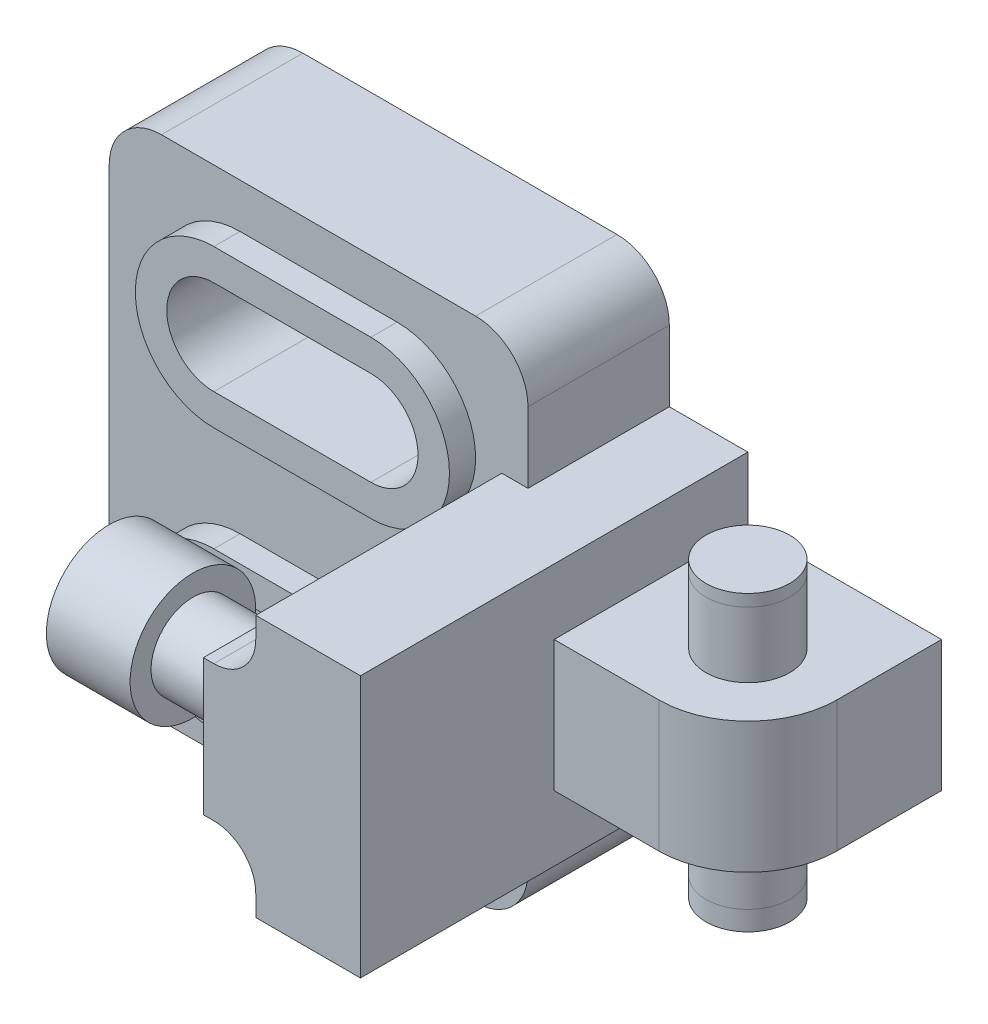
ISO-10303-21;
HEADER;
FILE_DESCRIPTION(('STEP AP214'),'2;1');
FILE_NAME('part.step','',(''),(''),'','','');
FILE_SCHEMA(('AUTOMOTIVE_DESIGN { 1 0 10303 214 1 1 1 1 }'));
ENDSEC;
DATA;
#1=APPLICATION_CONTEXT('core data for automotive mechanical design processes');
#2=APPLICATION_PROTOCOL_DEFINITION('international standard','automotive_design',2000,#1);
#3=PRODUCT_CONTEXT('',#1,'mechanical');
#4=PRODUCT('Part','Part','',(#3));
#5=PRODUCT_RELATED_PRODUCT_CATEGORY('part','',(#4));
#6=PRODUCT_DEFINITION_FORMATION('','',#4);
#7=PRODUCT_DEFINITION_CONTEXT('part definition',#1,'design');
#8=PRODUCT_DEFINITION('design','',#6,#7);
#9=PRODUCT_DEFINITION_SHAPE('','',#8);
#10=(LENGTH_UNIT() NAMED_UNIT(*) SI_UNIT(.MILLI.,.METRE.));
#11=(NAMED_UNIT(*) PLANE_ANGLE_UNIT() SI_UNIT($,.RADIAN.));
#12=(NAMED_UNIT(*) SI_UNIT($,.STERADIAN.) SOLID_ANGLE_UNIT());
#13=UNCERTAINTY_MEASURE_WITH_UNIT(LENGTH_MEASURE(1.E-05),#10,'distance_accuracy_value','');
#14=(GEOMETRIC_REPRESENTATION_CONTEXT(3) GLOBAL_UNCERTAINTY_ASSIGNED_CONTEXT((#13)) GLOBAL_UNIT_ASSIGNED_CONTEXT((#10,
#11,#12)) REPRESENTATION_CONTEXT('',''));
#15=CARTESIAN_POINT('',(0.,0.,0.));
#16=DIRECTION('',(0.,0.,1.));
#17=DIRECTION('',(1.,0.,0.));
#18=AXIS2_PLACEMENT_3D('',#15,#16,#17);
#19=CARTESIAN_POINT('',(4.30731492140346E-09,65.,27.));
#20=DIRECTION('',(0.,1.,0.));
#21=DIRECTION('',(-1.,0.,0.));
#22=AXIS2_PLACEMENT_3D('',#19,#20,#21);
#23=PLANE('',#22);
#24=CARTESIAN_POINT('',(-1.4630320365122E-09,65.,27.));
#25=CARTESIAN_POINT('',(-1.4630320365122E-09,65.,27.2083333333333));
#26=CARTESIAN_POINT('',(-1.4630320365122E-09,65.,27.4166666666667));
#27=CARTESIAN_POINT('',(-1.4630320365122E-09,65.,27.8333333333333));
#28=CARTESIAN_POINT('',(-1.4630320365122E-09,65.,28.0416666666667));
#29=CARTESIAN_POINT('',(-1.4630320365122E-09,65.,28.4583333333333));
#30=CARTESIAN_POINT('',(-1.4630320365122E-09,65.,28.6666666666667));
#31=CARTESIAN_POINT('',(-1.4630320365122E-09,65.,29.0833333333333));
#32=CARTESIAN_POINT('',(-1.4630320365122E-09,65.,29.2916666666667));
#33=CARTESIAN_POINT('',(-1.4630320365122E-09,65.,29.7083333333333));
#34=CARTESIAN_POINT('',(-1.4630320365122E-09,65.,29.9166666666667));
#35=CARTESIAN_POINT('',(-1.4630320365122E-09,65.,30.3333333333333));
#36=CARTESIAN_POINT('',(-1.4630320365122E-09,65.,30.5416666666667));
#37=CARTESIAN_POINT('',(-1.4630320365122E-09,65.,30.9583333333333));
#38=CARTESIAN_POINT('',(-1.4630320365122E-09,65.,31.1666666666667));
#39=CARTESIAN_POINT('',(-1.4630320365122E-09,65.,31.5833333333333));
#40=CARTESIAN_POINT('',(-1.4630320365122E-09,65.,31.7916666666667));
#41=CARTESIAN_POINT('',(-1.4630320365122E-09,65.,32.));
#42=B_SPLINE_CURVE_WITH_KNOTS('',3,(#24,#25,#26,#27,#28,#29,#30,#31,#32,#33,#34,#35,#36,#37,#38,
#39,#40,#41),.UNSPECIFIED.,.F.,.F.,(4,2,2,2,2,2,2,2,4),(0.,0.625000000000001,1.25,1.875,2.5,
3.125,3.75,4.375,5.),.UNSPECIFIED.);
#43=CARTESIAN_POINT('',(4.30731318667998E-09,65.,27.));
#44=VERTEX_POINT('',#43);
#45=CARTESIAN_POINT('',(-1.30814080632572E-09,65.,32.));
#46=VERTEX_POINT('',#45);
#47=EDGE_CURVE('E1289',#44,#46,#42,.T.);
#48=ORIENTED_EDGE('',*,*,#47,.F.);
#49=DIRECTION('',(1.,0.,0.));
#50=VECTOR('',#49,1.);
#51=CARTESIAN_POINT('',(25.0000000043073,65.,27.));
#52=LINE('',#51,#50);
#53=CARTESIAN_POINT('',(-29.9999999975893,65.0000000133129,27.));
#54=VERTEX_POINT('',#53);
#55=EDGE_CURVE('E559',#54,#44,#52,.T.);
#56=ORIENTED_EDGE('',*,*,#55,.F.);
#57=CARTESIAN_POINT('',(-30.000000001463,65.,32.));
#58=CARTESIAN_POINT('',(-30.000000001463,65.,31.7916666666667));
#59=CARTESIAN_POINT('',(-30.000000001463,65.,31.5833333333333));
#60=CARTESIAN_POINT('',(-30.000000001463,65.,31.1666666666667));
#61=CARTESIAN_POINT('',(-30.000000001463,65.,30.9583333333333));
#62=CARTESIAN_POINT('',(-30.000000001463,65.,30.5416666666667));
#63=CARTESIAN_POINT('',(-30.000000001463,65.,30.3333333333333));
#64=CARTESIAN_POINT('',(-30.000000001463,65.,29.9166666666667));
#65=CARTESIAN_POINT('',(-30.000000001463,65.,29.7083333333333));
#66=CARTESIAN_POINT('',(-30.000000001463,65.,29.2916666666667));
#67=CARTESIAN_POINT('',(-30.000000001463,65.,29.0833333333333));
#68=CARTESIAN_POINT('',(-30.000000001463,65.,28.6666666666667));
#69=CARTESIAN_POINT('',(-30.000000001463,65.,28.4583333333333));
#70=CARTESIAN_POINT('',(-30.000000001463,65.,28.0416666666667));
#71=CARTESIAN_POINT('',(-30.000000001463,65.,27.8333333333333));
#72=CARTESIAN_POINT('',(-30.000000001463,65.,27.4166666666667));
#73=CARTESIAN_POINT('',(-30.000000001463,65.,27.2083333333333));
#74=CARTESIAN_POINT('',(-30.000000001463,65.,27.));
#75=B_SPLINE_CURVE_WITH_KNOTS('',3,(#57,#58,#59,#60,#61,#62,#63,#64,#65,#66,#67,#68,#69,#70,#71,
#72,#73,#74),.UNSPECIFIED.,.F.,.F.,(4,2,2,2,2,2,2,2,4),(0.,0.625000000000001,1.25,1.875,2.5,
3.125,3.75,4.375,5.),.UNSPECIFIED.);
#76=CARTESIAN_POINT('',(-29.9999999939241,65.,32.));
#77=VERTEX_POINT('',#76);
#78=EDGE_CURVE('E424',#54,#77,#75,.F.);
#79=ORIENTED_EDGE('',*,*,#78,.T.);
#80=CARTESIAN_POINT('',(-29.9999999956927,65.,32.));
#81=DIRECTION('',(1.,0.,0.));
#82=VECTOR('',#81,1.);
#83=LINE('',#80,#82);
#84=EDGE_CURVE('E3543',#77,#46,#83,.T.);
#85=ORIENTED_EDGE('',*,*,#84,.T.);
#86=EDGE_LOOP('',(#48,#56,#79,#85));
#87=FACE_BOUND('',#86,.T.);
#88=ADVANCED_FACE('F23',(#87),#23,.T.);
#89=CARTESIAN_POINT('',(4.30731492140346E-09,-15.,27.));
#90=DIRECTION('',(0.,-1.,0.));
#91=DIRECTION('',(0.,0.,1.));
#92=AXIS2_PLACEMENT_3D('',#89,#90,#91);
#93=PLANE('',#92);
#94=CARTESIAN_POINT('',(-29.9999999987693,-15.,27.));
#95=CARTESIAN_POINT('',(-29.9999999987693,-15.,27.2083333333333));
#96=CARTESIAN_POINT('',(-29.9999999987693,-15.,27.4166666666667));
#97=CARTESIAN_POINT('',(-29.9999999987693,-15.,27.8333333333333));
#98=CARTESIAN_POINT('',(-29.9999999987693,-15.,28.0416666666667));
#99=CARTESIAN_POINT('',(-29.9999999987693,-15.,28.4583333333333));
#100=CARTESIAN_POINT('',(-29.9999999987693,-15.,28.6666666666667));
#101=CARTESIAN_POINT('',(-29.9999999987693,-15.,29.0833333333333));
#102=CARTESIAN_POINT('',(-29.9999999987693,-15.,29.2916666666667));
#103=CARTESIAN_POINT('',(-29.9999999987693,-15.,29.7083333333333));
#104=CARTESIAN_POINT('',(-29.9999999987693,-15.,29.9166666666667));
#105=CARTESIAN_POINT('',(-29.9999999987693,-15.,30.3333333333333));
#106=CARTESIAN_POINT('',(-29.9999999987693,-15.,30.5416666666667));
#107=CARTESIAN_POINT('',(-29.9999999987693,-15.,30.9583333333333));
#108=CARTESIAN_POINT('',(-29.9999999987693,-15.,31.1666666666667));
#109=CARTESIAN_POINT('',(-29.9999999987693,-15.,31.5833333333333));
#110=CARTESIAN_POINT('',(-29.9999999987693,-15.,31.7916666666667));
#111=CARTESIAN_POINT('',(-29.9999999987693,-15.,32.));
#112=B_SPLINE_CURVE_WITH_KNOTS('',3,(#94,#95,#96,#97,#98,#99,#100,#101,#102,#103,#104,#105,#106,
#107,#108,#109,#110,#111),.UNSPECIFIED.,.F.,.F.,(4,2,2,2,2,2,2,2,4),(0.,0.625000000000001,1.25,
1.875,2.5,3.125,3.75,4.375,5.),.UNSPECIFIED.);
#113=CARTESIAN_POINT('',(-29.9999999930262,-15.,32.));
#114=VERTEX_POINT('',#113);
#115=CARTESIAN_POINT('',(-29.9999999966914,-15.,27.));
#116=VERTEX_POINT('',#115);
#117=EDGE_CURVE('E413',#114,#116,#112,.F.);
#118=ORIENTED_EDGE('',*,*,#117,.T.);
#119=DIRECTION('',(1.,0.,0.));
#120=VECTOR('',#119,1.);
#121=CARTESIAN_POINT('',(4.30731492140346E-09,-15.,27.));
#122=LINE('',#121,#120);
#123=CARTESIAN_POINT('',(3.25494665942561E-09,-15.0000000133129,27.));
#124=VERTEX_POINT('',#123);
#125=EDGE_CURVE('E432',#116,#124,#122,.T.);
#126=ORIENTED_EDGE('',*,*,#125,.T.);
#127=CARTESIAN_POINT('',(1.2307634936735E-09,-15.,32.));
#128=CARTESIAN_POINT('',(1.2307634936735E-09,-15.,31.7916666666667));
#129=CARTESIAN_POINT('',(1.2307634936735E-09,-15.,31.5833333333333));
#130=CARTESIAN_POINT('',(1.2307634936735E-09,-15.,31.1666666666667));
#131=CARTESIAN_POINT('',(1.2307634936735E-09,-15.,30.9583333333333));
#132=CARTESIAN_POINT('',(1.2307634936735E-09,-15.,30.5416666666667));
#133=CARTESIAN_POINT('',(1.2307634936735E-09,-15.,30.3333333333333));
#134=CARTESIAN_POINT('',(1.2307634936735E-09,-15.,29.9166666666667));
#135=CARTESIAN_POINT('',(1.2307634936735E-09,-15.,29.7083333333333));
#136=CARTESIAN_POINT('',(1.2307634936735E-09,-15.,29.2916666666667));
#137=CARTESIAN_POINT('',(1.2307634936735E-09,-15.,29.0833333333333));
#138=CARTESIAN_POINT('',(1.2307634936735E-09,-15.,28.6666666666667));
#139=CARTESIAN_POINT('',(1.2307634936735E-09,-15.,28.4583333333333));
#140=CARTESIAN_POINT('',(1.2307634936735E-09,-15.,28.0416666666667));
#141=CARTESIAN_POINT('',(1.2307634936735E-09,-15.,27.8333333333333));
#142=CARTESIAN_POINT('',(1.2307634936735E-09,-15.,27.4166666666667));
#143=CARTESIAN_POINT('',(1.2307634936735E-09,-15.,27.2083333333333));
#144=CARTESIAN_POINT('',(1.2307634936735E-09,-15.,27.));
#145=B_SPLINE_CURVE_WITH_KNOTS('',3,(#127,#128,#129,#130,#131,#132,#133,#134,#135,#136,#137,
#138,#139,#140,#141,#142,#143,#144),.UNSPECIFIED.,.F.,.F.,(4,2,2,2,2,2,2,2,4),(0.,
0.625000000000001,1.25,1.875,2.5,3.125,3.75,4.375,5.),.UNSPECIFIED.);
#146=CARTESIAN_POINT('',(-4.1020803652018E-10,-15.,32.));
#147=VERTEX_POINT('',#146);
#148=EDGE_CURVE('E437',#124,#147,#145,.F.);
#149=ORIENTED_EDGE('',*,*,#148,.T.);
#150=CARTESIAN_POINT('',(4.30731492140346E-09,-15.,32.));
#151=DIRECTION('',(-1.,0.,0.));
#152=VECTOR('',#151,1.);
#153=LINE('',#150,#152);
#154=EDGE_CURVE('E434',#147,#114,#153,.T.);
#155=ORIENTED_EDGE('',*,*,#154,.T.);
#156=EDGE_LOOP('',(#118,#126,#149,#155));
#157=FACE_BOUND('',#156,.T.);
#158=ADVANCED_FACE('F430',(#157),#93,.T.);
#159=CARTESIAN_POINT('',(-54.9999999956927,72.5,0.));
#160=DIRECTION('',(0.,0.,-1.));
#161=DIRECTION('',(1.,0.,0.));
#162=AXIS2_PLACEMENT_3D('',#159,#160,#161);
#163=PLANE('',#162);
#164=CARTESIAN_POINT('',(0.,50.,0.));
#165=DIRECTION('',(0.,0.,-1.));
#166=DIRECTION('',(1.,0.,0.));
#167=AXIS2_PLACEMENT_3D('',#164,#165,#166);
#168=CIRCLE('',#167,9.);
#169=CARTESIAN_POINT('',(0.,59.,0.));
#170=VERTEX_POINT('',#169);
#171=CARTESIAN_POINT('',(0.,41.,0.));
#172=VERTEX_POINT('',#171);
#173=EDGE_CURVE('E815',#170,#172,#168,.T.);
#174=ORIENTED_EDGE('',*,*,#173,.F.);
#175=DIRECTION('',(1.,0.,0.));
#176=VECTOR('',#175,1.);
#177=CARTESIAN_POINT('',(-54.9999999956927,59.,0.));
#178=LINE('',#177,#176);
#179=CARTESIAN_POINT('',(-30.,59.,0.));
#180=VERTEX_POINT('',#179);
#181=EDGE_CURVE('E867',#180,#170,#178,.T.);
#182=ORIENTED_EDGE('',*,*,#181,.F.);
#183=CARTESIAN_POINT('',(-30.,50.,0.));
#184=DIRECTION('',(0.,0.,-1.));
#185=DIRECTION('',(1.,0.,0.));
#186=AXIS2_PLACEMENT_3D('',#183,#184,#185);
#187=CIRCLE('',#186,9.);
#188=CARTESIAN_POINT('',(-30.,41.,0.));
#189=VERTEX_POINT('',#188);
#190=EDGE_CURVE('E871',#189,#180,#187,.T.);
#191=ORIENTED_EDGE('',*,*,#190,.F.);
#192=DIRECTION('',(-1.,0.,0.));
#193=VECTOR('',#192,1.);
#194=CARTESIAN_POINT('',(-54.9999999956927,41.,0.));
#195=LINE('',#194,#193);
#196=EDGE_CURVE('E821',#172,#189,#195,.T.);
#197=ORIENTED_EDGE('',*,*,#196,.F.);
#198=EDGE_LOOP('',(#174,#182,#191,#197));
#199=FACE_BOUND('',#198,.T.);
#200=CARTESIAN_POINT('',(0.,0.,0.));
#201=DIRECTION('',(0.,0.,-1.));
#202=DIRECTION('',(1.,0.,0.));
#203=AXIS2_PLACEMENT_3D('',#200,#201,#202);
#204=CIRCLE('',#203,9.);
#205=CARTESIAN_POINT('',(0.,9.,0.));
#206=VERTEX_POINT('',#205);
#207=CARTESIAN_POINT('',(0.,-9.,0.));
#208=VERTEX_POINT('',#207);
#209=EDGE_CURVE('E829',#206,#208,#204,.T.);
#210=ORIENTED_EDGE('',*,*,#209,.F.);
#211=DIRECTION('',(1.,0.,0.));
#212=VECTOR('',#211,1.);
#213=CARTESIAN_POINT('',(-54.9999999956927,9.,0.));
#214=LINE('',#213,#212);
#215=CARTESIAN_POINT('',(-30.,9.,0.));
#216=VERTEX_POINT('',#215);
#217=EDGE_CURVE('E853',#216,#206,#214,.T.);
#218=ORIENTED_EDGE('',*,*,#217,.F.);
#219=CARTESIAN_POINT('',(-30.,0.,0.));
#220=DIRECTION('',(0.,0.,-1.));
#221=DIRECTION('',(1.,0.,0.));
#222=AXIS2_PLACEMENT_3D('',#219,#220,#221);
#223=CIRCLE('',#222,9.);
#224=CARTESIAN_POINT('',(-30.,-9.,0.));
#225=VERTEX_POINT('',#224);
#226=EDGE_CURVE('E848',#225,#216,#223,.T.);
#227=ORIENTED_EDGE('',*,*,#226,.F.);
#228=DIRECTION('',(-1.,0.,0.));
#229=VECTOR('',#228,1.);
#230=CARTESIAN_POINT('',(-54.9999999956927,-9.,0.));
#231=LINE('',#230,#229);
#232=EDGE_CURVE('E835',#208,#225,#231,.T.);
#233=ORIENTED_EDGE('',*,*,#232,.F.);
#234=EDGE_LOOP('',(#210,#218,#227,#233));
#235=FACE_BOUND('',#234,.T.);
#236=DIRECTION('',(0.,-1.,0.));
#237=VECTOR('',#236,1.);
#238=CARTESIAN_POINT('',(-54.9999999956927,62.5,0.));
#239=LINE('',#238,#237);
#240=CARTESIAN_POINT('',(-54.9999999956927,62.4999999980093,0.));
#241=VERTEX_POINT('',#240);
#242=CARTESIAN_POINT('',(-54.9999999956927,63.5,0.));
#243=VERTEX_POINT('',#242);
#244=EDGE_CURVE('E535',#241,#243,#239,.F.);
#245=ORIENTED_EDGE('',*,*,#244,.T.);
#246=CARTESIAN_POINT('',(-44.9999999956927,63.5,0.));
#247=DIRECTION('',(0.,0.,-1.));
#248=DIRECTION('',(-1.,0.,0.));
#249=AXIS2_PLACEMENT_3D('',#246,#247,#248);
#250=CIRCLE('',#249,10.);
#251=CARTESIAN_POINT('',(-44.9999999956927,73.5,0.));
#252=VERTEX_POINT('',#251);
#253=EDGE_CURVE('E32',#243,#252,#250,.T.);
#254=ORIENTED_EDGE('',*,*,#253,.T.);
#255=DIRECTION('',(-1.,0.,0.));
#256=VECTOR('',#255,1.);
#257=CARTESIAN_POINT('',(-54.9999999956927,73.5,0.));
#258=LINE('',#257,#256);
#259=CARTESIAN_POINT('',(15.0000000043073,73.5,0.));
#260=VERTEX_POINT('',#259);
#261=EDGE_CURVE('E555',#260,#252,#258,.T.);
#262=ORIENTED_EDGE('',*,*,#261,.F.);
#263=CARTESIAN_POINT('',(15.0000000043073,63.5,0.));
#264=DIRECTION('',(0.,0.,-1.));
#265=DIRECTION('',(-1.,0.,0.));
#266=AXIS2_PLACEMENT_3D('',#263,#264,#265);
#267=CIRCLE('',#266,10.);
#268=CARTESIAN_POINT('',(25.0000000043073,63.5,0.));
#269=VERTEX_POINT('',#268);
#270=EDGE_CURVE('E39',#260,#269,#267,.T.);
#271=ORIENTED_EDGE('',*,*,#270,.T.);
#272=DIRECTION('',(0.,-1.,0.));
#273=VECTOR('',#272,1.);
#274=CARTESIAN_POINT('',(25.0000000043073,72.5,0.));
#275=LINE('',#274,#273);
#276=CARTESIAN_POINT('',(25.0000000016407,62.4999999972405,0.));
#277=VERTEX_POINT('',#276);
#278=EDGE_CURVE('E3506',#277,#269,#275,.F.);
#279=ORIENTED_EDGE('',*,*,#278,.F.);
#280=CARTESIAN_POINT('',(25.0000000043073,50.,0.));
#281=DIRECTION('',(0.,1.,0.));
#282=VECTOR('',#281,1.);
#283=LINE('',#280,#282);
#284=CARTESIAN_POINT('',(25.0000000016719,50.0000000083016,0.));
#285=VERTEX_POINT('',#284);
#286=EDGE_CURVE('E1773',#285,#277,#283,.T.);
#287=ORIENTED_EDGE('',*,*,#286,.F.);
#288=CARTESIAN_POINT('',(25.0000000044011,50.,0.));
#289=DIRECTION('',(1.,0.,0.));
#290=VECTOR('',#289,1.);
#291=LINE('',#288,#290);
#292=CARTESIAN_POINT('',(40.0000000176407,50.0000000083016,0.));
#293=VERTEX_POINT('',#292);
#294=EDGE_CURVE('E1832',#285,#293,#291,.T.);
#295=ORIENTED_EDGE('',*,*,#294,.T.);
#296=DIRECTION('',(0.,-1.,0.));
#297=VECTOR('',#296,1.);
#298=CARTESIAN_POINT('',(40.0000000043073,72.5,0.));
#299=LINE('',#298,#297);
#300=CARTESIAN_POINT('',(40.0000000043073,37.5,0.));
#301=VERTEX_POINT('',#300);
#302=EDGE_CURVE('E2023',#293,#301,#299,.T.);
#303=ORIENTED_EDGE('',*,*,#302,.T.);
#304=DIRECTION('',(1.,0.,0.));
#305=VECTOR('',#304,1.);
#306=CARTESIAN_POINT('',(-54.9999999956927,37.5,0.));
#307=LINE('',#306,#305);
#308=CARTESIAN_POINT('',(77.0000000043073,37.4999999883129,0.));
#309=VERTEX_POINT('',#308);
#310=EDGE_CURVE('E2030',#301,#309,#307,.T.);
#311=ORIENTED_EDGE('',*,*,#310,.T.);
#312=CARTESIAN_POINT('',(77.0000000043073,37.4999999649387,0.));
#313=DIRECTION('',(0.,-1.,0.));
#314=VECTOR('',#313,1.);
#315=LINE('',#312,#314);
#316=CARTESIAN_POINT('',(77.0000000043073,12.5000000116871,0.));
#317=VERTEX_POINT('',#316);
#318=EDGE_CURVE('E1718',#309,#317,#315,.T.);
#319=ORIENTED_EDGE('',*,*,#318,.T.);
#320=DIRECTION('',(1.,0.,0.));
#321=VECTOR('',#320,1.);
#322=CARTESIAN_POINT('',(-54.9999999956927,12.5,0.));
#323=LINE('',#322,#321);
#324=CARTESIAN_POINT('',(40.0000000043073,12.5,0.));
#325=VERTEX_POINT('',#324);
#326=EDGE_CURVE('E2027',#317,#325,#323,.F.);
#327=ORIENTED_EDGE('',*,*,#326,.T.);
#328=DIRECTION('',(0.,-1.,0.));
#329=VECTOR('',#328,1.);
#330=CARTESIAN_POINT('',(40.0000000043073,72.5,0.));
#331=LINE('',#330,#329);
#332=CARTESIAN_POINT('',(40.0000000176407,-8.30160246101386E-09,0.));
#333=VERTEX_POINT('',#332);
#334=EDGE_CURVE('E3822',#325,#333,#331,.T.);
#335=ORIENTED_EDGE('',*,*,#334,.T.);
#336=CARTESIAN_POINT('',(25.000000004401,0.,0.));
#337=DIRECTION('',(1.,0.,0.));
#338=VECTOR('',#337,1.);
#339=LINE('',#336,#338);
#340=CARTESIAN_POINT('',(25.0000000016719,-8.30160246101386E-09,0.));
#341=VERTEX_POINT('',#340);
#342=EDGE_CURVE('E1859',#341,#333,#339,.T.);
#343=ORIENTED_EDGE('',*,*,#342,.F.);
#344=CARTESIAN_POINT('',(25.0000000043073,-12.5,0.));
#345=DIRECTION('',(0.,1.,0.));
#346=VECTOR('',#345,1.);
#347=LINE('',#344,#346);
#348=CARTESIAN_POINT('',(25.0000000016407,-12.4999999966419,0.));
#349=VERTEX_POINT('',#348);
#350=EDGE_CURVE('E1817',#349,#341,#347,.T.);
#351=ORIENTED_EDGE('',*,*,#350,.F.);
#352=DIRECTION('',(0.,1.,0.));
#353=VECTOR('',#352,1.);
#354=CARTESIAN_POINT('',(25.0000000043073,-12.5,0.));
#355=LINE('',#354,#353);
#356=CARTESIAN_POINT('',(25.0000000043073,-13.5,0.));
#357=VERTEX_POINT('',#356);
#358=EDGE_CURVE('E447',#349,#357,#355,.F.);
#359=ORIENTED_EDGE('',*,*,#358,.T.);
#360=CARTESIAN_POINT('',(15.0000000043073,-13.5,0.));
#361=DIRECTION('',(0.,0.,-1.));
#362=DIRECTION('',(-1.,0.,0.));
#363=AXIS2_PLACEMENT_3D('',#360,#361,#362);
#364=CIRCLE('',#363,10.);
#365=CARTESIAN_POINT('',(15.0000000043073,-23.5,0.));
#366=VERTEX_POINT('',#365);
#367=EDGE_CURVE('E478',#357,#366,#364,.T.);
#368=ORIENTED_EDGE('',*,*,#367,.T.);
#369=DIRECTION('',(1.,0.,0.));
#370=VECTOR('',#369,1.);
#371=CARTESIAN_POINT('',(25.0000000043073,-23.5,0.));
#372=LINE('',#371,#370);
#373=CARTESIAN_POINT('',(-44.9999999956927,-23.5,0.));
#374=VERTEX_POINT('',#373);
#375=EDGE_CURVE('E543',#374,#366,#372,.T.);
#376=ORIENTED_EDGE('',*,*,#375,.F.);
#377=CARTESIAN_POINT('',(-44.9999999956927,-13.5,0.));
#378=DIRECTION('',(0.,0.,-1.));
#379=DIRECTION('',(-1.,0.,0.));
#380=AXIS2_PLACEMENT_3D('',#377,#378,#379);
#381=CIRCLE('',#380,10.);
#382=CARTESIAN_POINT('',(-54.9999999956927,-13.5,0.));
#383=VERTEX_POINT('',#382);
#384=EDGE_CURVE('E475',#374,#383,#381,.T.);
#385=ORIENTED_EDGE('',*,*,#384,.T.);
#386=DIRECTION('',(0.,1.,0.));
#387=VECTOR('',#386,1.);
#388=CARTESIAN_POINT('',(-54.9999999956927,72.5,0.));
#389=LINE('',#388,#387);
#390=CARTESIAN_POINT('',(-54.9999999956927,-12.4999999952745,0.));
#391=VERTEX_POINT('',#390);
#392=EDGE_CURVE('E524',#391,#383,#389,.F.);
#393=ORIENTED_EDGE('',*,*,#392,.F.);
#394=CARTESIAN_POINT('',(-54.9999999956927,62.5,0.));
#395=DIRECTION('',(0.,-1.,0.));
#396=VECTOR('',#395,1.);
#397=LINE('',#394,#396);
#398=EDGE_CURVE('E1826',#241,#391,#397,.T.);
#399=ORIENTED_EDGE('',*,*,#398,.F.);
#400=EDGE_LOOP('',(#245,#254,#262,#271,#279,#287,#295,#303,#311,#319,#327,#335,#343,#351,#359,
#368,#376,#385,#393,#399));
#401=FACE_BOUND('',#400,.T.);
#402=ADVANCED_FACE('F546',(#199,#235,#401),#163,.T.);
#403=CARTESIAN_POINT('',(-54.9999999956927,62.5,0.));
#404=DIRECTION('',(-1.,0.,0.));
#405=DIRECTION('',(0.,-1.,0.));
#406=AXIS2_PLACEMENT_3D('',#403,#404,#405);
#407=PLANE('',#406);
#408=DIRECTION('',(0.,1.,0.));
#409=VECTOR('',#408,1.);
#410=CARTESIAN_POINT('',(-54.9999999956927,72.5,27.));
#411=LINE('',#410,#409);
#412=CARTESIAN_POINT('',(-54.9999999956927,62.4999999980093,27.));
#413=VERTEX_POINT('',#412);
#414=CARTESIAN_POINT('',(-54.9999999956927,63.5,27.));
#415=VERTEX_POINT('',#414);
#416=EDGE_CURVE('E599',#413,#415,#411,.T.);
#417=ORIENTED_EDGE('',*,*,#416,.T.);
#418=DIRECTION('',(0.,0.,1.));
#419=VECTOR('',#418,1.);
#420=CARTESIAN_POINT('',(-54.9999999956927,63.5,0.));
#421=LINE('',#420,#419);
#422=EDGE_CURVE('E47',#415,#243,#421,.F.);
#423=ORIENTED_EDGE('',*,*,#422,.T.);
#424=ORIENTED_EDGE('',*,*,#244,.F.);
#425=ORIENTED_EDGE('',*,*,#398,.T.);
#426=ORIENTED_EDGE('',*,*,#392,.T.);
#427=DIRECTION('',(0.,0.,-1.));
#428=VECTOR('',#427,1.);
#429=CARTESIAN_POINT('',(-54.9999999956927,-13.5,27.));
#430=LINE('',#429,#428);
#431=CARTESIAN_POINT('',(-54.9999999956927,-13.5,27.));
#432=VERTEX_POINT('',#431);
#433=EDGE_CURVE('E482',#383,#432,#430,.F.);
#434=ORIENTED_EDGE('',*,*,#433,.T.);
#435=DIRECTION('',(0.,-1.,0.));
#436=VECTOR('',#435,1.);
#437=CARTESIAN_POINT('',(-54.9999999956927,62.5,27.));
#438=LINE('',#437,#436);
#439=CARTESIAN_POINT('',(-54.9999999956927,-12.4999999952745,27.));
#440=VERTEX_POINT('',#439);
#441=EDGE_CURVE('E521',#440,#432,#438,.T.);
#442=ORIENTED_EDGE('',*,*,#441,.F.);
#443=CARTESIAN_POINT('',(-54.9999999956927,-12.4999999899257,27.));
#444=DIRECTION('',(0.,1.,0.));
#445=VECTOR('',#444,1.);
#446=LINE('',#443,#445);
#447=EDGE_CURVE('E532',#440,#413,#446,.T.);
#448=ORIENTED_EDGE('',*,*,#447,.T.);
#449=EDGE_LOOP('',(#417,#423,#424,#425,#426,#434,#442,#448));
#450=FACE_BOUND('',#449,.T.);
#451=ADVANCED_FACE('F519',(#450),#407,.T.);
#452=CARTESIAN_POINT('',(-54.9999999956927,72.5,27.));
#453=DIRECTION('',(0.,0.,-1.));
#454=DIRECTION('',(1.,0.,0.));
#455=AXIS2_PLACEMENT_3D('',#452,#453,#454);
#456=PLANE('',#455);
#457=DIRECTION('',(1.,0.,0.));
#458=VECTOR('',#457,1.);
#459=CARTESIAN_POINT('',(-44.9999999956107,73.5,27.));
#460=LINE('',#459,#458);
#461=CARTESIAN_POINT('',(-44.9999999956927,73.5,27.));
#462=VERTEX_POINT('',#461);
#463=CARTESIAN_POINT('',(15.0000000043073,73.5,27.));
#464=VERTEX_POINT('',#463);
#465=EDGE_CURVE('E549',#462,#464,#460,.T.);
#466=ORIENTED_EDGE('',*,*,#465,.F.);
#467=CARTESIAN_POINT('',(-44.9999999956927,63.5,27.));
#468=DIRECTION('',(0.,0.,-1.));
#469=DIRECTION('',(-1.,0.,0.));
#470=AXIS2_PLACEMENT_3D('',#467,#468,#469);
#471=CIRCLE('',#470,10.);
#472=EDGE_CURVE('E499',#462,#415,#471,.F.);
#473=ORIENTED_EDGE('',*,*,#472,.T.);
#474=ORIENTED_EDGE('',*,*,#416,.F.);
#475=ORIENTED_EDGE('',*,*,#447,.F.);
#476=ORIENTED_EDGE('',*,*,#441,.T.);
#477=CARTESIAN_POINT('',(-44.9999999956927,-13.5,27.));
#478=DIRECTION('',(0.,0.,-1.));
#479=DIRECTION('',(-1.,0.,0.));
#480=AXIS2_PLACEMENT_3D('',#477,#478,#479);
#481=CIRCLE('',#480,10.);
#482=CARTESIAN_POINT('',(-44.9999999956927,-23.5,27.));
#483=VERTEX_POINT('',#482);
#484=EDGE_CURVE('E466',#432,#483,#481,.F.);
#485=ORIENTED_EDGE('',*,*,#484,.T.);
#486=DIRECTION('',(-1.,0.,0.));
#487=VECTOR('',#486,1.);
#488=CARTESIAN_POINT('',(15.0000000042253,-23.5,27.));
#489=LINE('',#488,#487);
#490=CARTESIAN_POINT('',(15.0000000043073,-23.5,27.));
#491=VERTEX_POINT('',#490);
#492=EDGE_CURVE('E545',#491,#483,#489,.T.);
#493=ORIENTED_EDGE('',*,*,#492,.F.);
#494=CARTESIAN_POINT('',(15.0000000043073,-13.5,27.));
#495=DIRECTION('',(0.,0.,-1.));
#496=DIRECTION('',(-1.,0.,0.));
#497=AXIS2_PLACEMENT_3D('',#494,#495,#496);
#498=CIRCLE('',#497,10.);
#499=CARTESIAN_POINT('',(25.0000000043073,-13.5,27.));
#500=VERTEX_POINT('',#499);
#501=EDGE_CURVE('E469',#491,#500,#498,.F.);
#502=ORIENTED_EDGE('',*,*,#501,.T.);
#503=DIRECTION('',(0.,-1.,0.));
#504=VECTOR('',#503,1.);
#505=CARTESIAN_POINT('',(25.0000000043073,72.5,27.));
#506=LINE('',#505,#504);
#507=CARTESIAN_POINT('',(25.0000000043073,-12.4999999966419,27.));
#508=VERTEX_POINT('',#507);
#509=EDGE_CURVE('E456',#508,#500,#506,.T.);
#510=ORIENTED_EDGE('',*,*,#509,.F.);
#511=CARTESIAN_POINT('',(25.0000000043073,-2.49048802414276E-08,27.));
#512=DIRECTION('',(0.,-1.,0.));
#513=VECTOR('',#512,1.);
#514=LINE('',#511,#513);
#515=CARTESIAN_POINT('',(25.0000000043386,-8.30160246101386E-09,27.0000000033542));
#516=VERTEX_POINT('',#515);
#517=EDGE_CURVE('E1947',#516,#508,#514,.T.);
#518=ORIENTED_EDGE('',*,*,#517,.F.);
#519=CARTESIAN_POINT('',(20.000000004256,0.,27.));
#520=DIRECTION('',(1.,0.,0.));
#521=VECTOR('',#520,1.);
#522=LINE('',#519,#521);
#523=CARTESIAN_POINT('',(20.0000000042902,-8.30160246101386E-09,27.0000000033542));
#524=VERTEX_POINT('',#523);
#525=EDGE_CURVE('E1943',#524,#516,#522,.T.);
#526=ORIENTED_EDGE('',*,*,#525,.F.);
#527=CARTESIAN_POINT('',(20.0000000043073,3.99999996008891,27.));
#528=DIRECTION('',(0.,-1.,0.));
#529=VECTOR('',#528,1.);
#530=LINE('',#527,#529);
#531=CARTESIAN_POINT('',(20.0000000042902,3.9999999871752,27.));
#532=VERTEX_POINT('',#531);
#533=EDGE_CURVE('E1937',#532,#524,#530,.T.);
#534=ORIENTED_EDGE('',*,*,#533,.F.);
#535=CARTESIAN_POINT('',(12.0000000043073,4.,27.));
#536=DIRECTION('',(0.,0.,-1.));
#537=DIRECTION('',(-3.84689892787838E-10,1.,0.));
#538=AXIS2_PLACEMENT_3D('',#535,#536,#537);
#539=CIRCLE('',#538,7.99999999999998);
#540=CARTESIAN_POINT('',(12.0000000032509,12.0000000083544,27.));
#541=VERTEX_POINT('',#540);
#542=EDGE_CURVE('E1933',#541,#532,#539,.T.);
#543=ORIENTED_EDGE('',*,*,#542,.F.);
#544=CARTESIAN_POINT('',(10.0000000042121,12.,27.));
#545=DIRECTION('',(1.,0.,0.));
#546=VECTOR('',#545,1.);
#547=LINE('',#544,#546);
#548=CARTESIAN_POINT('',(10.0000000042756,12.0000000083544,27.));
#549=VERTEX_POINT('',#548);
#550=EDGE_CURVE('E1930',#549,#541,#547,.T.);
#551=ORIENTED_EDGE('',*,*,#550,.F.);
#552=CARTESIAN_POINT('',(10.0000000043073,37.9999999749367,27.));
#553=DIRECTION('',(0.,-1.,0.));
#554=VECTOR('',#553,1.);
#555=LINE('',#552,#554);
#556=CARTESIAN_POINT('',(10.0000000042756,37.9999999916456,27.));
#557=VERTEX_POINT('',#556);
#558=EDGE_CURVE('E1927',#557,#549,#555,.T.);
#559=ORIENTED_EDGE('',*,*,#558,.F.);
#560=CARTESIAN_POINT('',(12.0000000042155,38.,27.));
#561=DIRECTION('',(-1.,0.,0.));
#562=VECTOR('',#561,1.);
#563=LINE('',#560,#562);
#564=CARTESIAN_POINT('',(12.0000000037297,37.9999999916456,27.));
#565=VERTEX_POINT('',#564);
#566=EDGE_CURVE('E1161',#565,#557,#563,.T.);
#567=ORIENTED_EDGE('',*,*,#566,.F.);
#568=CARTESIAN_POINT('',(12.0000000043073,46.,27.));
#569=DIRECTION('',(0.,0.,-1.));
#570=DIRECTION('',(1.,0.,0.));
#571=AXIS2_PLACEMENT_3D('',#568,#569,#570);
#572=CIRCLE('',#571,7.99999999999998);
#573=CARTESIAN_POINT('',(20.0000000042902,46.0000000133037,27.));
#574=VERTEX_POINT('',#573);
#575=EDGE_CURVE('E1145',#574,#565,#572,.T.);
#576=ORIENTED_EDGE('',*,*,#575,.F.);
#577=CARTESIAN_POINT('',(20.0000000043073,50.0000000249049,27.));
#578=DIRECTION('',(0.,-1.,0.));
#579=VECTOR('',#578,1.);
#580=LINE('',#577,#579);
#581=CARTESIAN_POINT('',(20.0000000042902,50.0000000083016,27.0000000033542));
#582=VERTEX_POINT('',#581);
#583=EDGE_CURVE('E1133',#582,#574,#580,.T.);
#584=ORIENTED_EDGE('',*,*,#583,.F.);
#585=CARTESIAN_POINT('',(25.0000000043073,50.,27.));
#586=DIRECTION('',(-1.,0.,0.));
#587=VECTOR('',#586,1.);
#588=LINE('',#585,#587);
#589=CARTESIAN_POINT('',(25.0000000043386,50.0000000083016,27.0000000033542));
#590=VERTEX_POINT('',#589);
#591=EDGE_CURVE('E1276',#590,#582,#588,.T.);
#592=ORIENTED_EDGE('',*,*,#591,.F.);
#593=CARTESIAN_POINT('',(25.0000000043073,62.4999999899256,27.));
#594=DIRECTION('',(0.,-1.,0.));
#595=VECTOR('',#594,1.);
#596=LINE('',#593,#595);
#597=CARTESIAN_POINT('',(25.0000000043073,62.4999999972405,27.));
#598=VERTEX_POINT('',#597);
#599=EDGE_CURVE('E1954',#598,#590,#596,.T.);
#600=ORIENTED_EDGE('',*,*,#599,.F.);
#601=DIRECTION('',(0.,1.,0.));
#602=VECTOR('',#601,1.);
#603=CARTESIAN_POINT('',(25.0000000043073,50.,27.));
#604=LINE('',#603,#602);
#605=CARTESIAN_POINT('',(25.0000000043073,63.5,27.));
#606=VERTEX_POINT('',#605);
#607=EDGE_CURVE('E3513',#598,#606,#604,.T.);
#608=ORIENTED_EDGE('',*,*,#607,.T.);
#609=CARTESIAN_POINT('',(15.0000000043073,63.5,27.));
#610=DIRECTION('',(0.,0.,-1.));
#611=DIRECTION('',(-1.,0.,0.));
#612=AXIS2_PLACEMENT_3D('',#609,#610,#611);
#613=CIRCLE('',#612,10.);
#614=EDGE_CURVE('E502',#606,#464,#613,.F.);
#615=ORIENTED_EDGE('',*,*,#614,.T.);
#616=EDGE_LOOP('',(#466,#473,#474,#475,#476,#485,#493,#502,#510,#518,#526,#534,#543,#551,#559,
#567,#576,#584,#592,#600,#608,#615));
#617=FACE_BOUND('',#616,.T.);
#618=ORIENTED_EDGE('',*,*,#55,.T.);
#619=CARTESIAN_POINT('',(4.30731492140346E-09,50.,27.));
#620=DIRECTION('',(0.,0.,1.));
#621=DIRECTION('',(1.,1.79586438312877E-10,0.));
#622=AXIS2_PLACEMENT_3D('',#619,#620,#621);
#623=CIRCLE('',#622,15.);
#624=CARTESIAN_POINT('',(15.00000000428,50.0000000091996,27.));
#625=VERTEX_POINT('',#624);
#626=EDGE_CURVE('E3529',#625,#44,#623,.T.);
#627=ORIENTED_EDGE('',*,*,#626,.F.);
#628=CARTESIAN_POINT('',(4.30731492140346E-09,50.,27.));
#629=DIRECTION('',(0.,0.,1.));
#630=DIRECTION('',(-2.05103428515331E-10,-1.,0.));
#631=AXIS2_PLACEMENT_3D('',#628,#629,#630);
#632=CIRCLE('',#631,15.);
#633=CARTESIAN_POINT('',(3.25494665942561E-09,35.0000000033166,27.));
#634=VERTEX_POINT('',#633);
#635=EDGE_CURVE('E1605',#634,#625,#632,.T.);
#636=ORIENTED_EDGE('',*,*,#635,.F.);
#637=CARTESIAN_POINT('',(-29.9999999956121,35.,27.));
#638=DIRECTION('',(1.,0.,0.));
#639=VECTOR('',#638,1.);
#640=LINE('',#637,#639);
#641=CARTESIAN_POINT('',(-29.9999999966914,35.0000000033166,27.));
#642=VERTEX_POINT('',#641);
#643=EDGE_CURVE('E1499',#642,#634,#640,.T.);
#644=ORIENTED_EDGE('',*,*,#643,.F.);
#645=CARTESIAN_POINT('',(-29.9999999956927,50.,27.));
#646=DIRECTION('',(0.,0.,1.));
#647=DIRECTION('',(-3.84689733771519E-10,1.,0.));
#648=AXIS2_PLACEMENT_3D('',#645,#646,#647);
#649=CIRCLE('',#648,15.);
#650=EDGE_CURVE('E1367',#54,#642,#649,.T.);
#651=ORIENTED_EDGE('',*,*,#650,.F.);
#652=EDGE_LOOP('',(#618,#627,#636,#644,#651));
#653=FACE_BOUND('',#652,.T.);
#654=CARTESIAN_POINT('',(4.30731492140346E-09,0.,27.));
#655=DIRECTION('',(0.,0.,1.));
#656=DIRECTION('',(-2.05103428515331E-10,-1.,0.));
#657=AXIS2_PLACEMENT_3D('',#654,#655,#656);
#658=CIRCLE('',#657,15.);
#659=CARTESIAN_POINT('',(15.00000000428,-7.40370265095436E-09,27.));
#660=VERTEX_POINT('',#659);
#661=EDGE_CURVE('E443',#124,#660,#658,.T.);
#662=ORIENTED_EDGE('',*,*,#661,.F.);
#663=ORIENTED_EDGE('',*,*,#125,.F.);
#664=CARTESIAN_POINT('',(-29.9999999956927,0.,27.));
#665=DIRECTION('',(0.,0.,1.));
#666=DIRECTION('',(-3.84689733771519E-10,1.,0.));
#667=AXIS2_PLACEMENT_3D('',#664,#665,#666);
#668=CIRCLE('',#667,15.);
#669=CARTESIAN_POINT('',(-29.9999999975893,14.9999999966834,27.));
#670=VERTEX_POINT('',#669);
#671=EDGE_CURVE('E408',#670,#116,#668,.T.);
#672=ORIENTED_EDGE('',*,*,#671,.F.);
#673=CARTESIAN_POINT('',(4.22675956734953E-09,15.,27.));
#674=DIRECTION('',(-1.,0.,0.));
#675=VECTOR('',#674,1.);
#676=LINE('',#673,#675);
#677=CARTESIAN_POINT('',(2.35701388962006E-09,14.9999999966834,27.));
#678=VERTEX_POINT('',#677);
#679=EDGE_CURVE('E425',#678,#670,#676,.T.);
#680=ORIENTED_EDGE('',*,*,#679,.F.);
#681=CARTESIAN_POINT('',(4.30731492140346E-09,0.,27.));
#682=DIRECTION('',(0.,0.,1.));
#683=DIRECTION('',(1.,1.79586368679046E-10,0.));
#684=AXIS2_PLACEMENT_3D('',#681,#682,#683);
#685=CIRCLE('',#684,15.);
#686=EDGE_CURVE('E1968',#660,#678,#685,.T.);
#687=ORIENTED_EDGE('',*,*,#686,.F.);
#688=EDGE_LOOP('',(#662,#663,#672,#680,#687));
#689=FACE_BOUND('',#688,.T.);
#690=ADVANCED_FACE('F441',(#617,#653,#689),#456,.F.);
#691=CARTESIAN_POINT('',(25.0000000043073,-12.5,0.));
#692=DIRECTION('',(1.,0.,0.));
#693=DIRECTION('',(0.,1.,0.));
#694=AXIS2_PLACEMENT_3D('',#691,#692,#693);
#695=PLANE('',#694);
#696=ORIENTED_EDGE('',*,*,#509,.T.);
#697=DIRECTION('',(0.,0.,1.));
#698=VECTOR('',#697,1.);
#699=CARTESIAN_POINT('',(25.0000000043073,-13.5,0.));
#700=LINE('',#699,#698);
#701=EDGE_CURVE('E472',#500,#357,#700,.F.);
#702=ORIENTED_EDGE('',*,*,#701,.T.);
#703=ORIENTED_EDGE('',*,*,#358,.F.);
#704=ORIENTED_EDGE('',*,*,#350,.T.);
#705=CARTESIAN_POINT('',(25.0000000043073,0.,0.));
#706=DIRECTION('',(0.,0.,1.));
#707=VECTOR('',#706,1.);
#708=LINE('',#705,#707);
#709=EDGE_CURVE('E1833',#341,#516,#708,.T.);
#710=ORIENTED_EDGE('',*,*,#709,.T.);
#711=ORIENTED_EDGE('',*,*,#517,.T.);
#712=EDGE_LOOP('',(#696,#702,#703,#704,#710,#711));
#713=FACE_BOUND('',#712,.T.);
#714=ADVANCED_FACE('F727',(#713),#695,.T.);
#715=CARTESIAN_POINT('',(25.0000000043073,50.,0.));
#716=DIRECTION('',(1.,0.,0.));
#717=DIRECTION('',(0.,1.,0.));
#718=AXIS2_PLACEMENT_3D('',#715,#716,#717);
#719=PLANE('',#718);
#720=ORIENTED_EDGE('',*,*,#278,.T.);
#721=DIRECTION('',(0.,0.,-1.));
#722=VECTOR('',#721,1.);
#723=CARTESIAN_POINT('',(25.0000000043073,63.5,27.));
#724=LINE('',#723,#722);
#725=EDGE_CURVE('E13',#269,#606,#724,.F.);
#726=ORIENTED_EDGE('',*,*,#725,.T.);
#727=ORIENTED_EDGE('',*,*,#607,.F.);
#728=ORIENTED_EDGE('',*,*,#599,.T.);
#729=CARTESIAN_POINT('',(25.0000000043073,50.,27.0000000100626));
#730=DIRECTION('',(0.,0.,-1.));
#731=VECTOR('',#730,1.);
#732=LINE('',#729,#731);
#733=EDGE_CURVE('E1487',#590,#285,#732,.T.);
#734=ORIENTED_EDGE('',*,*,#733,.T.);
#735=ORIENTED_EDGE('',*,*,#286,.T.);
#736=EDGE_LOOP('',(#720,#726,#727,#728,#734,#735));
#737=FACE_BOUND('',#736,.T.);
#738=ADVANCED_FACE('F730',(#737),#719,.T.);
#739=CARTESIAN_POINT('',(-13.9999999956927,35.322447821,63.059054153));
#740=DIRECTION('',(-1.,0.,0.));
#741=DIRECTION('',(0.,-0.407506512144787,-0.913202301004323));
#742=AXIS2_PLACEMENT_3D('',#739,#740,#741);
#743=PLANE('',#742);
#744=CARTESIAN_POINT('',(-13.9999999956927,32.38132632,56.706164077));
#745=DIRECTION('',(0.,-0.809512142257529,-0.587103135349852));
#746=VECTOR('',#745,1.);
#747=LINE('',#744,#746);
#748=CARTESIAN_POINT('',(-13.9999999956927,32.3813263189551,56.7061640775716));
#749=VERTEX_POINT('',#748);
#750=CARTESIAN_POINT('',(-13.9999999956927,25.8381175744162,51.9606659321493));
#751=VERTEX_POINT('',#750);
#752=EDGE_CURVE('E2404',#749,#751,#747,.T.);
#753=ORIENTED_EDGE('',*,*,#752,.T.);
#754=CARTESIAN_POINT('',(-13.9999999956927,18.456791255,55.254501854));
#755=DIRECTION('',(0.,0.913202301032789,-0.407506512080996));
#756=VECTOR('',#755,1.);
#757=LINE('',#754,#756);
#758=CARTESIAN_POINT('',(-13.9999999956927,18.4567912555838,55.2545018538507));
#759=VERTEX_POINT('',#758);
#760=EDGE_CURVE('E2380',#759,#751,#757,.T.);
#761=ORIENTED_EDGE('',*,*,#760,.F.);
#762=CARTESIAN_POINT('',(-13.9999999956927,17.61867368,63.293835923));
#763=DIRECTION('',(0.,0.103690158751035,-0.994609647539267));
#764=VECTOR('',#763,1.);
#765=LINE('',#762,#764);
#766=CARTESIAN_POINT('',(-13.9999999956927,17.6186736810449,63.2938359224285));
#767=VERTEX_POINT('',#766);
#768=EDGE_CURVE('E2356',#767,#759,#765,.T.);
#769=ORIENTED_EDGE('',*,*,#768,.F.);
#770=CARTESIAN_POINT('',(-13.9999999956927,17.61867368,63.293835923));
#771=DIRECTION('',(0.,0.809512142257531,0.58710313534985));
#772=VECTOR('',#771,1.);
#773=LINE('',#770,#772);
#774=CARTESIAN_POINT('',(-13.9999999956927,24.1618824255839,68.0393340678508));
#775=VERTEX_POINT('',#774);
#776=EDGE_CURVE('E834',#767,#775,#773,.T.);
#777=ORIENTED_EDGE('',*,*,#776,.T.);
#778=CARTESIAN_POINT('',(-13.9999999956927,24.161882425,68.039334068));
#779=DIRECTION('',(0.,0.913202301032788,-0.407506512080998));
#780=VECTOR('',#779,1.);
#781=LINE('',#778,#780);
#782=CARTESIAN_POINT('',(-13.9999999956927,31.5432087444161,64.7454981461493));
#783=VERTEX_POINT('',#782);
#784=EDGE_CURVE('E2435',#775,#783,#781,.T.);
#785=ORIENTED_EDGE('',*,*,#784,.T.);
#786=CARTESIAN_POINT('',(-13.9999999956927,32.38132632,56.706164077));
#787=DIRECTION('',(0.,-0.103690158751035,0.994609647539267));
#788=VECTOR('',#787,1.);
#789=LINE('',#786,#788);
#790=EDGE_CURVE('E2411',#749,#783,#789,.T.);
#791=ORIENTED_EDGE('',*,*,#790,.F.);
#792=EDGE_LOOP('',(#753,#761,#769,#777,#785,#791));
#793=FACE_BOUND('',#792,.T.);
#794=ADVANCED_FACE('F2841',(#793),#743,.T.);
#795=CARTESIAN_POINT('',(-13.9999999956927,17.61867368,63.293835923));
#796=DIRECTION('',(0.,-0.587103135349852,0.809512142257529));
#797=DIRECTION('',(0.,0.809512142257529,0.587103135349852));
#798=AXIS2_PLACEMENT_3D('',#795,#796,#797);
#799=PLANE('',#798);
#800=CARTESIAN_POINT('',(-21.9999999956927,17.61867368,63.293835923));
#801=DIRECTION('',(1.,0.,0.));
#802=VECTOR('',#801,1.);
#803=LINE('',#800,#802);
#804=CARTESIAN_POINT('',(-21.9999999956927,17.6186736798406,63.2938359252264));
#805=VERTEX_POINT('',#804);
#806=EDGE_CURVE('E2364',#805,#767,#803,.T.);
#807=ORIENTED_EDGE('',*,*,#806,.F.);
#808=CARTESIAN_POINT('',(-21.9999999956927,17.6186736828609,63.2938359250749));
#809=DIRECTION('',(0.,0.809512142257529,0.587103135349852));
#810=VECTOR('',#809,1.);
#811=LINE('',#808,#810);
#812=CARTESIAN_POINT('',(-21.9999999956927,24.1618824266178,68.0393340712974));
#813=VERTEX_POINT('',#812);
#814=EDGE_CURVE('E2319',#805,#813,#811,.T.);
#815=ORIENTED_EDGE('',*,*,#814,.T.);
#816=CARTESIAN_POINT('',(-21.9999999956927,24.161882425,68.039334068));
#817=DIRECTION('',(1.,0.,0.));
#818=VECTOR('',#817,1.);
#819=LINE('',#816,#818);
#820=EDGE_CURVE('E2427',#813,#775,#819,.T.);
#821=ORIENTED_EDGE('',*,*,#820,.T.);
#822=ORIENTED_EDGE('',*,*,#776,.F.);
#823=EDGE_LOOP('',(#807,#815,#821,#822));
#824=FACE_BOUND('',#823,.T.);
#825=ADVANCED_FACE('F2866',(#824),#799,.F.);
#826=CARTESIAN_POINT('',(-13.9999999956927,24.161882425,68.039334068));
#827=DIRECTION('',(0.,0.407506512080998,0.913202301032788));
#828=DIRECTION('',(0.,0.913202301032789,-0.407506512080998));
#829=AXIS2_PLACEMENT_3D('',#826,#827,#828);
#830=PLANE('',#829);
#831=CARTESIAN_POINT('',(-21.9999999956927,24.1618824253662,68.0393340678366));
#832=DIRECTION('',(0.,0.913202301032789,-0.407506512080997));
#833=VECTOR('',#832,1.);
#834=LINE('',#831,#833);
#835=CARTESIAN_POINT('',(-21.9999999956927,31.5432087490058,64.7454981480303));
#836=VERTEX_POINT('',#835);
#837=EDGE_CURVE('E2312',#813,#836,#834,.T.);
#838=ORIENTED_EDGE('',*,*,#837,.T.);
#839=CARTESIAN_POINT('',(-13.9999999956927,31.543208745,64.745498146));
#840=DIRECTION('',(-1.,0.,0.));
#841=VECTOR('',#840,1.);
#842=LINE('',#839,#841);
#843=EDGE_CURVE('E2419',#783,#836,#842,.T.);
#844=ORIENTED_EDGE('',*,*,#843,.F.);
#845=ORIENTED_EDGE('',*,*,#784,.F.);
#846=ORIENTED_EDGE('',*,*,#820,.F.);
#847=EDGE_LOOP('',(#838,#844,#845,#846));
#848=FACE_BOUND('',#847,.T.);
#849=ADVANCED_FACE('F2878',(#848),#830,.F.);
#850=CARTESIAN_POINT('',(-13.9999999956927,32.38132632,56.706164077));
#851=DIRECTION('',(0.,-0.994609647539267,-0.103690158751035));
#852=DIRECTION('',(0.,-0.103690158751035,0.994609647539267));
#853=AXIS2_PLACEMENT_3D('',#850,#851,#852);
#854=PLANE('',#853);
#855=CARTESIAN_POINT('',(-21.9999999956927,32.38132632,56.706164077));
#856=DIRECTION('',(1.,0.,0.));
#857=VECTOR('',#856,1.);
#858=LINE('',#855,#857);
#859=CARTESIAN_POINT('',(-21.9999999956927,32.3813263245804,56.7061640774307));
#860=VERTEX_POINT('',#859);
#861=EDGE_CURVE('E2396',#860,#749,#858,.T.);
#862=ORIENTED_EDGE('',*,*,#861,.T.);
#863=ORIENTED_EDGE('',*,*,#790,.T.);
#864=ORIENTED_EDGE('',*,*,#843,.T.);
#865=CARTESIAN_POINT('',(-21.9999999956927,31.543208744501,64.7454981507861));
#866=DIRECTION('',(0.,0.103690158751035,-0.994609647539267));
#867=VECTOR('',#866,1.);
#868=LINE('',#865,#867);
#869=EDGE_CURVE('E2305',#836,#860,#868,.T.);
#870=ORIENTED_EDGE('',*,*,#869,.T.);
#871=EDGE_LOOP('',(#862,#863,#864,#870));
#872=FACE_BOUND('',#871,.T.);
#873=ADVANCED_FACE('F2890',(#872),#854,.T.);
#874=CARTESIAN_POINT('',(-13.9999999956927,32.38132632,56.706164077));
#875=DIRECTION('',(0.,0.587103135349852,-0.809512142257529));
#876=DIRECTION('',(0.,-0.809512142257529,-0.587103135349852));
#877=AXIS2_PLACEMENT_3D('',#874,#875,#876);
#878=PLANE('',#877);
#879=CARTESIAN_POINT('',(-21.9999999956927,32.3813263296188,56.706164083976));
#880=DIRECTION('',(0.,-0.809512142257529,-0.587103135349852));
#881=VECTOR('',#880,1.);
#882=LINE('',#879,#881);
#883=CARTESIAN_POINT('',(-21.9999999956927,25.8381175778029,51.9606659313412));
#884=VERTEX_POINT('',#883);
#885=EDGE_CURVE('E2298',#860,#884,#882,.T.);
#886=ORIENTED_EDGE('',*,*,#885,.T.);
#887=CARTESIAN_POINT('',(-13.9999999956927,25.838117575,51.960665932));
#888=DIRECTION('',(-1.,0.,0.));
#889=VECTOR('',#888,1.);
#890=LINE('',#887,#889);
#891=EDGE_CURVE('E2388',#751,#884,#890,.T.);
#892=ORIENTED_EDGE('',*,*,#891,.F.);
#893=ORIENTED_EDGE('',*,*,#752,.F.);
#894=ORIENTED_EDGE('',*,*,#861,.F.);
#895=EDGE_LOOP('',(#886,#892,#893,#894));
#896=FACE_BOUND('',#895,.T.);
#897=ADVANCED_FACE('F2902',(#896),#878,.F.);
#898=CARTESIAN_POINT('',(-13.9999999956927,18.456791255,55.254501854));
#899=DIRECTION('',(0.,0.407506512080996,0.913202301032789));
#900=DIRECTION('',(0.,0.913202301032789,-0.407506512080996));
#901=AXIS2_PLACEMENT_3D('',#898,#899,#900);
#902=PLANE('',#901);
#903=CARTESIAN_POINT('',(-13.9999999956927,18.456791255,55.254501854));
#904=DIRECTION('',(-1.,0.,0.));
#905=VECTOR('',#904,1.);
#906=LINE('',#903,#905);
#907=CARTESIAN_POINT('',(-21.9999999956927,18.4567912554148,55.2545018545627));
#908=VERTEX_POINT('',#907);
#909=EDGE_CURVE('E2372',#759,#908,#906,.T.);
#910=ORIENTED_EDGE('',*,*,#909,.F.);
#911=ORIENTED_EDGE('',*,*,#760,.T.);
#912=ORIENTED_EDGE('',*,*,#891,.T.);
#913=CARTESIAN_POINT('',(-21.9999999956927,25.8381175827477,51.9606659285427));
#914=DIRECTION('',(0.,-0.913202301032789,0.407506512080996));
#915=VECTOR('',#914,1.);
#916=LINE('',#913,#915);
#917=EDGE_CURVE('E2291',#884,#908,#916,.T.);
#918=ORIENTED_EDGE('',*,*,#917,.T.);
#919=EDGE_LOOP('',(#910,#911,#912,#918));
#920=FACE_BOUND('',#919,.T.);
#921=ADVANCED_FACE('F2914',(#920),#902,.T.);
#922=CARTESIAN_POINT('',(-13.9999999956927,17.61867368,63.293835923));
#923=DIRECTION('',(0.,0.994609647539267,0.103690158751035));
#924=DIRECTION('',(0.,0.103690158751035,-0.994609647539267));
#925=AXIS2_PLACEMENT_3D('',#922,#923,#924);
#926=PLANE('',#925);
#927=ORIENTED_EDGE('',*,*,#806,.T.);
#928=ORIENTED_EDGE('',*,*,#768,.T.);
#929=ORIENTED_EDGE('',*,*,#909,.T.);
#930=CARTESIAN_POINT('',(-21.9999999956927,18.4567912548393,55.2545018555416));
#931=DIRECTION('',(0.,-0.103690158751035,0.994609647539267));
#932=VECTOR('',#931,1.);
#933=LINE('',#930,#932);
#934=EDGE_CURVE('E2283',#908,#805,#933,.T.);
#935=ORIENTED_EDGE('',*,*,#934,.T.);
#936=EDGE_LOOP('',(#927,#928,#929,#935));
#937=FACE_BOUND('',#936,.T.);
#938=ADVANCED_FACE('F2926',(#937),#926,.T.);
#939=CARTESIAN_POINT('',(-21.9999999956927,31.226695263,43.922672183));
#940=DIRECTION('',(1.,0.,0.));
#941=DIRECTION('',(0.,0.407506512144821,0.913202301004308));
#942=AXIS2_PLACEMENT_3D('',#939,#940,#941);
#943=PLANE('',#942);
#944=ORIENTED_EDGE('',*,*,#917,.F.);
#945=ORIENTED_EDGE('',*,*,#885,.F.);
#946=ORIENTED_EDGE('',*,*,#869,.F.);
#947=ORIENTED_EDGE('',*,*,#837,.F.);
#948=ORIENTED_EDGE('',*,*,#814,.F.);
#949=ORIENTED_EDGE('',*,*,#934,.F.);
#950=EDGE_LOOP('',(#944,#945,#946,#947,#948,#949));
#951=FACE_BOUND('',#950,.T.);
#952=CARTESIAN_POINT('',(-21.9999999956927,25.,60.));
#953=DIRECTION('',(1.,0.,0.));
#954=DIRECTION('',(0.,-0.407506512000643,-0.913202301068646));
#955=AXIS2_PLACEMENT_3D('',#952,#953,#954);
#956=CIRCLE('',#955,12.0000000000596);
#957=CARTESIAN_POINT('',(-21.9999999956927,20.1099218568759,49.0415723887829));
#958=VERTEX_POINT('',#957);
#959=CARTESIAN_POINT('',(-21.9999999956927,29.8900781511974,70.9584276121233));
#960=VERTEX_POINT('',#959);
#961=EDGE_CURVE('E2249',#958,#960,#956,.T.);
#962=ORIENTED_EDGE('',*,*,#961,.F.);
#963=CARTESIAN_POINT('',(-21.9999999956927,25.,60.));
#964=DIRECTION('',(1.,0.,0.));
#965=DIRECTION('',(0.,0.407506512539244,0.913202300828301));
#966=AXIS2_PLACEMENT_3D('',#963,#964,#965);
#967=CIRCLE('',#966,12.0000000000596);
#968=EDGE_CURVE('E961',#960,#958,#967,.T.);
#969=ORIENTED_EDGE('',*,*,#968,.F.);
#970=EDGE_LOOP('',(#962,#969));
#971=FACE_BOUND('',#970,.T.);
#972=ADVANCED_FACE('F2827',(#951,#971),#943,.F.);
#973=CARTESIAN_POINT('',(-5.99999999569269,20.109921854,49.041572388));
#974=CARTESIAN_POINT('',(-21.9999999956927,20.109921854,49.041572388));
#975=B_SPLINE_CURVE_WITH_KNOTS('',1,(#973,#974),.UNSPECIFIED.,.F.,.F.,(2,2),(0.,1.),.UNSPECIFIED.);
#976=CARTESIAN_POINT('',(-40.9999999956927,25.,60.));
#977=DIRECTION('',(-1.,0.,0.));
#978=AXIS1_PLACEMENT('',#976,#977);
#979=SURFACE_OF_REVOLUTION('',#975,#978);
#980=ORIENTED_EDGE('',*,*,#961,.T.);
#981=ORIENTED_EDGE('',*,*,#968,.T.);
#982=EDGE_LOOP('',(#980,#981));
#983=FACE_BOUND('',#982,.T.);
#984=CARTESIAN_POINT('',(-5.99999999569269,25.,60.));
#985=DIRECTION('',(-1.,0.,0.));
#986=DIRECTION('',(0.,-0.407506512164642,-0.913202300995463));
#987=AXIS2_PLACEMENT_3D('',#984,#985,#986);
#988=CIRCLE('',#987,12.0000000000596);
#989=CARTESIAN_POINT('',(-5.99999999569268,20.1099218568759,49.0415723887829));
#990=VERTEX_POINT('',#989);
#991=CARTESIAN_POINT('',(-5.99999999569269,29.8900781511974,70.9584276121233));
#992=VERTEX_POINT('',#991);
#993=EDGE_CURVE('E940',#990,#992,#988,.T.);
#994=ORIENTED_EDGE('',*,*,#993,.T.);
#995=CARTESIAN_POINT('',(-5.99999999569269,25.,60.));
#996=DIRECTION('',(-1.,0.,0.));
#997=DIRECTION('',(0.,0.407506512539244,0.913202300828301));
#998=AXIS2_PLACEMENT_3D('',#995,#996,#997);
#999=CIRCLE('',#998,12.0000000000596);
#1000=EDGE_CURVE('E2224',#992,#990,#999,.T.);
#1001=ORIENTED_EDGE('',*,*,#1000,.T.);
#1002=EDGE_LOOP('',(#994,#1001));
#1003=FACE_BOUND('',#1002,.T.);
#1004=ADVANCED_FACE('F911',(#983,#1003),#979,.T.);
#1005=CARTESIAN_POINT('',(60.0000000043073,12.5,3.));
#1006=CARTESIAN_POINT('',(60.0000000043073,37.5,3.));
#1007=B_SPLINE_CURVE_WITH_KNOTS('',1,(#1005,#1006),.UNSPECIFIED.,.F.,.F.,(2,2),(0.,1.),.UNSPECIFIED.);
#1008=CARTESIAN_POINT('',(60.0000000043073,12.5,20.));
#1009=DIRECTION('',(0.,1.,0.));
#1010=AXIS1_PLACEMENT('',#1008,#1009);
#1011=SURFACE_OF_REVOLUTION('',#1007,#1010);
#1012=CARTESIAN_POINT('',(77.0000000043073,12.5,20.0000000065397));
#1013=CARTESIAN_POINT('',(77.0000000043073,13.5416666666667,20.0000000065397));
#1014=CARTESIAN_POINT('',(77.0000000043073,14.5833333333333,20.0000000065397));
#1015=CARTESIAN_POINT('',(77.0000000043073,16.6666666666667,20.0000000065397));
#1016=CARTESIAN_POINT('',(77.0000000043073,17.7083333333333,20.0000000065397));
#1017=CARTESIAN_POINT('',(77.0000000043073,19.7916666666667,20.0000000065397));
#1018=CARTESIAN_POINT('',(77.0000000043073,20.8333333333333,20.0000000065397));
#1019=CARTESIAN_POINT('',(77.0000000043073,22.9166666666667,20.0000000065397));
#1020=CARTESIAN_POINT('',(77.0000000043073,23.9583333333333,20.0000000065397));
#1021=CARTESIAN_POINT('',(77.0000000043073,26.0416666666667,20.0000000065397));
#1022=CARTESIAN_POINT('',(77.0000000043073,27.0833333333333,20.0000000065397));
#1023=CARTESIAN_POINT('',(77.0000000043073,29.1666666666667,20.0000000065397));
#1024=CARTESIAN_POINT('',(77.0000000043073,30.2083333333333,20.0000000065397));
#1025=CARTESIAN_POINT('',(77.0000000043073,32.2916666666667,20.0000000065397));
#1026=CARTESIAN_POINT('',(77.0000000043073,33.3333333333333,20.0000000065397));
#1027=CARTESIAN_POINT('',(77.0000000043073,35.4166666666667,20.0000000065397));
#1028=CARTESIAN_POINT('',(77.0000000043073,36.4583333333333,20.0000000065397));
#1029=CARTESIAN_POINT('',(77.0000000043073,37.5,20.0000000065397));
#1030=B_SPLINE_CURVE_WITH_KNOTS('',3,(#1012,#1013,#1014,#1015,#1016,#1017,#1018,#1019,#1020,
#1021,#1022,#1023,#1024,#1025,#1026,#1027,#1028,#1029),.UNSPECIFIED.,.F.,.F.,(4,2,2,2,2,2,2,2,
4),(0.,3.125,6.25,9.375,12.5,15.625,18.75,21.875,25.),.UNSPECIFIED.);
#1031=CARTESIAN_POINT('',(77.0000000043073,12.5,20.0000000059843));
#1032=VERTEX_POINT('',#1031);
#1033=CARTESIAN_POINT('',(77.0000000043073,37.5,20.0000000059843));
#1034=VERTEX_POINT('',#1033);
#1035=EDGE_CURVE('E1699',#1032,#1034,#1030,.T.);
#1036=ORIENTED_EDGE('',*,*,#1035,.T.);
#1037=CARTESIAN_POINT('',(60.0000000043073,37.5,20.));
#1038=DIRECTION('',(0.,-1.,0.));
#1039=DIRECTION('',(1.,0.,3.84689829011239E-10));
#1040=AXIS2_PLACEMENT_3D('',#1037,#1038,#1039);
#1041=CIRCLE('',#1040,17.);
#1042=CARTESIAN_POINT('',(60.0000000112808,37.5,37.));
#1043=VERTEX_POINT('',#1042);
#1044=EDGE_CURVE('E1709',#1034,#1043,#1041,.T.);
#1045=ORIENTED_EDGE('',*,*,#1044,.T.);
#1046=CARTESIAN_POINT('',(60.0000000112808,37.5,37.));
#1047=CARTESIAN_POINT('',(60.0000000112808,36.4583333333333,37.));
#1048=CARTESIAN_POINT('',(60.0000000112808,35.4166666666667,37.));
#1049=CARTESIAN_POINT('',(60.0000000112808,33.3333333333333,37.));
#1050=CARTESIAN_POINT('',(60.0000000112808,32.2916666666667,37.));
#1051=CARTESIAN_POINT('',(60.0000000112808,30.2083333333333,37.));
#1052=CARTESIAN_POINT('',(60.0000000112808,29.1666666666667,37.));
#1053=CARTESIAN_POINT('',(60.0000000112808,27.0833333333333,37.));
#1054=CARTESIAN_POINT('',(60.0000000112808,26.0416666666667,37.));
#1055=CARTESIAN_POINT('',(60.0000000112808,23.9583333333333,37.));
#1056=CARTESIAN_POINT('',(60.0000000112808,22.9166666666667,37.));
#1057=CARTESIAN_POINT('',(60.0000000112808,20.8333333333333,37.));
#1058=CARTESIAN_POINT('',(60.0000000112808,19.7916666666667,37.));
#1059=CARTESIAN_POINT('',(60.0000000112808,17.7083333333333,37.));
#1060=CARTESIAN_POINT('',(60.0000000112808,16.6666666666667,37.));
#1061=CARTESIAN_POINT('',(60.0000000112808,14.5833333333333,37.));
#1062=CARTESIAN_POINT('',(60.0000000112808,13.5416666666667,37.));
#1063=CARTESIAN_POINT('',(60.0000000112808,12.5,37.));
#1064=B_SPLINE_CURVE_WITH_KNOTS('',3,(#1046,#1047,#1048,#1049,#1050,#1051,#1052,#1053,#1054,
#1055,#1056,#1057,#1058,#1059,#1060,#1061,#1062,#1063),.UNSPECIFIED.,.F.,.F.,(4,2,2,2,2,2,2,2,
4),(0.,3.125,6.25,9.375,12.5,15.625,18.75,21.875,25.),.UNSPECIFIED.);
#1065=CARTESIAN_POINT('',(60.0000000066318,12.5,36.9999999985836));
#1066=VERTEX_POINT('',#1065);
#1067=EDGE_CURVE('E1727',#1043,#1066,#1064,.T.);
#1068=ORIENTED_EDGE('',*,*,#1067,.T.);
#1069=CARTESIAN_POINT('',(60.0000000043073,12.5,20.));
#1070=DIRECTION('',(0.,1.,0.));
#1071=DIRECTION('',(4.10206999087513E-10,0.,1.));
#1072=AXIS2_PLACEMENT_3D('',#1069,#1070,#1071);
#1073=CIRCLE('',#1072,17.);
#1074=EDGE_CURVE('E1688',#1032,#1066,#1073,.F.);
#1075=ORIENTED_EDGE('',*,*,#1074,.F.);
#1076=EDGE_LOOP('',(#1036,#1045,#1068,#1075));
#1077=FACE_BOUND('',#1076,.T.);
#1078=ADVANCED_FACE('F1659',(#1077),#1011,.T.);
#1079=CARTESIAN_POINT('',(-5.99999999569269,41.154035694,66.169359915));
#1080=DIRECTION('',(-1.,0.,0.));
#1081=DIRECTION('',(0.,-0.407506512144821,-0.913202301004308));
#1082=AXIS2_PLACEMENT_3D('',#1079,#1080,#1081);
#1083=PLANE('',#1082);
#1084=CARTESIAN_POINT('',(-5.99999999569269,25.,60.));
#1085=DIRECTION('',(1.,0.,0.));
#1086=DIRECTION('',(0.,-0.407506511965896,-0.913202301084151));
#1087=AXIS2_PLACEMENT_3D('',#1084,#1085,#1086);
#1088=CIRCLE('',#1087,7.99999999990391);
#1089=CARTESIAN_POINT('',(-5.99999999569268,21.7399479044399,52.6943815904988));
#1090=VERTEX_POINT('',#1089);
#1091=CARTESIAN_POINT('',(-5.99999999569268,28.2600520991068,67.3056184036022));
#1092=VERTEX_POINT('',#1091);
#1093=EDGE_CURVE('E2033',#1090,#1092,#1088,.T.);
#1094=ORIENTED_EDGE('',*,*,#1093,.F.);
#1095=CARTESIAN_POINT('',(-5.99999999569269,25.,60.));
#1096=DIRECTION('',(1.,0.,0.));
#1097=DIRECTION('',(0.,0.407506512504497,0.913202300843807));
#1098=AXIS2_PLACEMENT_3D('',#1095,#1096,#1097);
#1099=CIRCLE('',#1098,7.99999999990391);
#1100=EDGE_CURVE('E2039',#1092,#1090,#1099,.T.);
#1101=ORIENTED_EDGE('',*,*,#1100,.F.);
#1102=EDGE_LOOP('',(#1094,#1101));
#1103=FACE_BOUND('',#1102,.T.);
#1104=ORIENTED_EDGE('',*,*,#1000,.F.);
#1105=ORIENTED_EDGE('',*,*,#993,.F.);
#1106=EDGE_LOOP('',(#1104,#1105));
#1107=FACE_BOUND('',#1106,.T.);
#1108=ADVANCED_FACE('F1669',(#1103,#1107),#1083,.F.);
#1109=CARTESIAN_POINT('',(77.0000000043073,37.5,20.));
#1110=DIRECTION('',(-1.,0.,0.));
#1111=DIRECTION('',(0.,0.,-1.));
#1112=AXIS2_PLACEMENT_3D('',#1109,#1110,#1111);
#1113=PLANE('',#1112);
#1114=DIRECTION('',(0.,0.,1.));
#1115=VECTOR('',#1114,1.);
#1116=CARTESIAN_POINT('',(77.0000000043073,12.5,0.));
#1117=LINE('',#1116,#1115);
#1118=EDGE_CURVE('E2045',#317,#1032,#1117,.T.);
#1119=ORIENTED_EDGE('',*,*,#1118,.F.);
#1120=ORIENTED_EDGE('',*,*,#318,.F.);
#1121=DIRECTION('',(0.,0.,-1.));
#1122=VECTOR('',#1121,1.);
#1123=CARTESIAN_POINT('',(77.0000000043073,37.5,20.));
#1124=LINE('',#1123,#1122);
#1125=EDGE_CURVE('E1714',#309,#1034,#1124,.F.);
#1126=ORIENTED_EDGE('',*,*,#1125,.T.);
#1127=ORIENTED_EDGE('',*,*,#1035,.F.);
#1128=EDGE_LOOP('',(#1119,#1120,#1126,#1127));
#1129=FACE_BOUND('',#1128,.T.);
#1130=ADVANCED_FACE('F1716',(#1129),#1113,.F.);
#1131=CARTESIAN_POINT('',(77.0000000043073,37.5,0.));
#1132=DIRECTION('',(0.,-1.,0.));
#1133=DIRECTION('',(0.,0.,1.));
#1134=AXIS2_PLACEMENT_3D('',#1131,#1132,#1133);
#1135=PLANE('',#1134);
#1136=ORIENTED_EDGE('',*,*,#1044,.F.);
#1137=ORIENTED_EDGE('',*,*,#1125,.F.);
#1138=ORIENTED_EDGE('',*,*,#310,.F.);
#1139=DIRECTION('',(0.,0.,1.));
#1140=VECTOR('',#1139,1.);
#1141=CARTESIAN_POINT('',(40.0000000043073,37.5,0.));
#1142=LINE('',#1141,#1140);
#1143=CARTESIAN_POINT('',(40.0000000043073,37.5,36.9999999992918));
#1144=VERTEX_POINT('',#1143);
#1145=EDGE_CURVE('E2018',#301,#1144,#1142,.T.);
#1146=ORIENTED_EDGE('',*,*,#1145,.T.);
#1147=DIRECTION('',(-1.,0.,0.));
#1148=VECTOR('',#1147,1.);
#1149=CARTESIAN_POINT('',(80.4964157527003,37.5,37.));
#1150=LINE('',#1149,#1148);
#1151=EDGE_CURVE('E1723',#1144,#1043,#1150,.F.);
#1152=ORIENTED_EDGE('',*,*,#1151,.T.);
#1153=EDGE_LOOP('',(#1136,#1137,#1138,#1146,#1152));
#1154=FACE_BOUND('',#1153,.T.);
#1155=CARTESIAN_POINT('',(60.,37.5,20.));
#1156=DIRECTION('',(0.,1.,0.));
#1157=DIRECTION('',(0.,0.,-1.));
#1158=AXIS2_PLACEMENT_3D('',#1155,#1156,#1157);
#1159=CIRCLE('',#1158,8.);
#1160=CARTESIAN_POINT('',(60.,37.5,12.));
#1161=VERTEX_POINT('',#1160);
#1162=EDGE_CURVE('E2076',#1161,#1161,#1159,.T.);
#1163=ORIENTED_EDGE('',*,*,#1162,.F.);
#1164=EDGE_LOOP('',(#1163));
#1165=FACE_BOUND('',#1164,.T.);
#1166=ADVANCED_FACE('F1741',(#1154,#1165),#1135,.F.);
#1167=CARTESIAN_POINT('',(40.0000000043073,37.5,37.));
#1168=DIRECTION('',(0.,0.,-1.));
#1169=DIRECTION('',(1.,0.,0.));
#1170=AXIS2_PLACEMENT_3D('',#1167,#1168,#1169);
#1171=PLANE('',#1170);
#1172=ORIENTED_EDGE('',*,*,#1067,.F.);
#1173=ORIENTED_EDGE('',*,*,#1151,.F.);
#1174=DIRECTION('',(0.,-1.,0.));
#1175=VECTOR('',#1174,1.);
#1176=CARTESIAN_POINT('',(40.0000000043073,37.5,37.));
#1177=LINE('',#1176,#1175);
#1178=CARTESIAN_POINT('',(40.0000000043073,12.5000000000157,36.9999999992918));
#1179=VERTEX_POINT('',#1178);
#1180=EDGE_CURVE('E2022',#1144,#1179,#1177,.T.);
#1181=ORIENTED_EDGE('',*,*,#1180,.T.);
#1182=DIRECTION('',(-1.,0.,0.));
#1183=VECTOR('',#1182,1.);
#1184=CARTESIAN_POINT('',(77.0000000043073,12.5,37.));
#1185=LINE('',#1184,#1183);
#1186=EDGE_CURVE('E2049',#1066,#1179,#1185,.T.);
#1187=ORIENTED_EDGE('',*,*,#1186,.F.);
#1188=EDGE_LOOP('',(#1172,#1173,#1181,#1187));
#1189=FACE_BOUND('',#1188,.T.);
#1190=ADVANCED_FACE('F1751',(#1189),#1171,.F.);
#1191=CARTESIAN_POINT('',(77.0000000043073,12.5,0.));
#1192=DIRECTION('',(0.,-1.,0.));
#1193=DIRECTION('',(0.,0.,1.));
#1194=AXIS2_PLACEMENT_3D('',#1191,#1192,#1193);
#1195=PLANE('',#1194);
#1196=ORIENTED_EDGE('',*,*,#1074,.T.);
#1197=ORIENTED_EDGE('',*,*,#1186,.T.);
#1198=DIRECTION('',(0.,0.,1.));
#1199=VECTOR('',#1198,1.);
#1200=CARTESIAN_POINT('',(40.0000000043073,12.5,0.));
#1201=LINE('',#1200,#1199);
#1202=EDGE_CURVE('E3830',#1179,#325,#1201,.F.);
#1203=ORIENTED_EDGE('',*,*,#1202,.T.);
#1204=ORIENTED_EDGE('',*,*,#326,.F.);
#1205=ORIENTED_EDGE('',*,*,#1118,.T.);
#1206=EDGE_LOOP('',(#1196,#1197,#1203,#1204,#1205));
#1207=FACE_BOUND('',#1206,.T.);
#1208=CARTESIAN_POINT('',(60.,12.5,20.));
#1209=DIRECTION('',(0.,-1.,0.));
#1210=DIRECTION('',(0.,0.,1.));
#1211=AXIS2_PLACEMENT_3D('',#1208,#1209,#1210);
#1212=CIRCLE('',#1211,8.);
#1213=CARTESIAN_POINT('',(60.,12.5,28.));
#1214=VERTEX_POINT('',#1213);
#1215=EDGE_CURVE('E553',#1214,#1214,#1212,.T.);
#1216=ORIENTED_EDGE('',*,*,#1215,.F.);
#1217=EDGE_LOOP('',(#1216));
#1218=FACE_BOUND('',#1217,.T.);
#1219=ADVANCED_FACE('F1757',(#1207,#1218),#1195,.T.);
#1220=CARTESIAN_POINT('',(10.0000000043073,21.739947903,52.694381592));
#1221=CARTESIAN_POINT('',(-5.99999999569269,21.739947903,52.694381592));
#1222=B_SPLINE_CURVE_WITH_KNOTS('',1,(#1220,#1221),.UNSPECIFIED.,.F.,.F.,(2,2),(0.,1.),.UNSPECIFIED.);
#1223=CARTESIAN_POINT('',(-40.9999999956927,25.,60.));
#1224=DIRECTION('',(-1.,0.,0.));
#1225=AXIS1_PLACEMENT('',#1223,#1224);
#1226=SURFACE_OF_REVOLUTION('',#1222,#1225);
#1227=CARTESIAN_POINT('',(10.0000000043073,25.,60.));
#1228=DIRECTION('',(-1.,0.,0.));
#1229=DIRECTION('',(0.,-0.407506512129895,-0.913202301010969));
#1230=AXIS2_PLACEMENT_3D('',#1227,#1228,#1229);
#1231=CIRCLE('',#1230,7.99999999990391);
#1232=CARTESIAN_POINT('',(10.0000000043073,28.2600520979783,67.3056184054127));
#1233=VERTEX_POINT('',#1232);
#1234=CARTESIAN_POINT('',(10.0000000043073,21.7399479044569,52.6943815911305));
#1235=VERTEX_POINT('',#1234);
#1236=EDGE_CURVE('E1898',#1233,#1235,#1231,.F.);
#1237=ORIENTED_EDGE('',*,*,#1236,.F.);
#1238=CARTESIAN_POINT('',(10.0000000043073,25.,60.));
#1239=DIRECTION('',(-1.,0.,0.));
#1240=DIRECTION('',(0.,0.407506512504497,0.913202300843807));
#1241=AXIS2_PLACEMENT_3D('',#1238,#1239,#1240);
#1242=CIRCLE('',#1241,7.99999999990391);
#1243=EDGE_CURVE('E1895',#1235,#1233,#1242,.F.);
#1244=ORIENTED_EDGE('',*,*,#1243,.F.);
#1245=EDGE_LOOP('',(#1237,#1244));
#1246=FACE_BOUND('',#1245,.T.);
#1247=ORIENTED_EDGE('',*,*,#1093,.T.);
#1248=ORIENTED_EDGE('',*,*,#1100,.T.);
#1249=EDGE_LOOP('',(#1247,#1248));
#1250=FACE_BOUND('',#1249,.T.);
#1251=ADVANCED_FACE('F1671',(#1246,#1250),#1226,.T.);
#1252=CARTESIAN_POINT('',(40.0000000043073,50.,0.));
#1253=DIRECTION('',(-1.,0.,0.));
#1254=DIRECTION('',(0.,-1.,0.));
#1255=AXIS2_PLACEMENT_3D('',#1252,#1253,#1254);
#1256=PLANE('',#1255);
#1257=ORIENTED_EDGE('',*,*,#1202,.F.);
#1258=ORIENTED_EDGE('',*,*,#1180,.F.);
#1259=ORIENTED_EDGE('',*,*,#1145,.F.);
#1260=ORIENTED_EDGE('',*,*,#302,.F.);
#1261=DIRECTION('',(0.,0.,1.));
#1262=VECTOR('',#1261,1.);
#1263=CARTESIAN_POINT('',(40.0000000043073,50.,0.));
#1264=LINE('',#1263,#1262);
#1265=CARTESIAN_POINT('',(40.0000000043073,50.,74.));
#1266=VERTEX_POINT('',#1265);
#1267=EDGE_CURVE('E2000',#293,#1266,#1264,.T.);
#1268=ORIENTED_EDGE('',*,*,#1267,.T.);
#1269=DIRECTION('',(0.,-1.,0.));
#1270=VECTOR('',#1269,1.);
#1271=CARTESIAN_POINT('',(40.0000000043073,50.,74.));
#1272=LINE('',#1271,#1270);
#1273=CARTESIAN_POINT('',(40.0000000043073,0.,74.));
#1274=VERTEX_POINT('',#1273);
#1275=EDGE_CURVE('E2190',#1266,#1274,#1272,.T.);
#1276=ORIENTED_EDGE('',*,*,#1275,.T.);
#1277=DIRECTION('',(0.,0.,1.));
#1278=VECTOR('',#1277,1.);
#1279=CARTESIAN_POINT('',(40.0000000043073,0.,0.));
#1280=LINE('',#1279,#1278);
#1281=EDGE_CURVE('E1739',#333,#1274,#1280,.T.);
#1282=ORIENTED_EDGE('',*,*,#1281,.F.);
#1283=ORIENTED_EDGE('',*,*,#334,.F.);
#1284=EDGE_LOOP('',(#1257,#1258,#1259,#1260,#1268,#1276,#1282,#1283));
#1285=FACE_BOUND('',#1284,.T.);
#1286=ADVANCED_FACE('F1787',(#1285),#1256,.F.);
#1287=CARTESIAN_POINT('',(10.0000000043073,50.,74.));
#1288=DIRECTION('',(0.,0.,-1.));
#1289=DIRECTION('',(1.,0.,0.));
#1290=AXIS2_PLACEMENT_3D('',#1287,#1288,#1289);
#1291=PLANE('',#1290);
#1292=CARTESIAN_POINT('',(40.0000000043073,50.,74.));
#1293=DIRECTION('',(-1.,0.,0.));
#1294=VECTOR('',#1293,1.);
#1295=LINE('',#1292,#1294);
#1296=CARTESIAN_POINT('',(20.000000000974,50.,74.));
#1297=VERTEX_POINT('',#1296);
#1298=EDGE_CURVE('E1997',#1266,#1297,#1295,.T.);
#1299=ORIENTED_EDGE('',*,*,#1298,.T.);
#1300=CARTESIAN_POINT('',(20.0000000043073,46.,74.));
#1301=DIRECTION('',(0.,1.,0.));
#1302=VECTOR('',#1301,1.);
#1303=LINE('',#1300,#1302);
#1304=CARTESIAN_POINT('',(20.000000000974,45.9999999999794,74.));
#1305=VERTEX_POINT('',#1304);
#1306=EDGE_CURVE('E2188',#1305,#1297,#1303,.T.);
#1307=ORIENTED_EDGE('',*,*,#1306,.F.);
#1308=CARTESIAN_POINT('',(12.0000000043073,46.,74.));
#1309=DIRECTION('',(0.,0.,1.));
#1310=DIRECTION('',(-2.05103512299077E-10,-1.,0.));
#1311=AXIS2_PLACEMENT_3D('',#1308,#1309,#1310);
#1312=CIRCLE('',#1311,7.99999999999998);
#1313=CARTESIAN_POINT('',(12.0000000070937,37.9999999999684,74.));
#1314=VERTEX_POINT('',#1313);
#1315=EDGE_CURVE('E1152',#1305,#1314,#1312,.F.);
#1316=ORIENTED_EDGE('',*,*,#1315,.T.);
#1317=CARTESIAN_POINT('',(12.0000000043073,38.,74.));
#1318=DIRECTION('',(-1.,0.,0.));
#1319=VECTOR('',#1318,1.);
#1320=LINE('',#1317,#1319);
#1321=CARTESIAN_POINT('',(10.0000000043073,37.9999999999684,74.));
#1322=VERTEX_POINT('',#1321);
#1323=EDGE_CURVE('E1155',#1314,#1322,#1320,.T.);
#1324=ORIENTED_EDGE('',*,*,#1323,.T.);
#1325=CARTESIAN_POINT('',(10.0000000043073,12.,74.));
#1326=DIRECTION('',(0.,1.,0.));
#1327=VECTOR('',#1326,1.);
#1328=LINE('',#1325,#1327);
#1329=CARTESIAN_POINT('',(10.0000000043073,12.0000000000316,74.));
#1330=VERTEX_POINT('',#1329);
#1331=EDGE_CURVE('E1906',#1330,#1322,#1328,.T.);
#1332=ORIENTED_EDGE('',*,*,#1331,.F.);
#1333=CARTESIAN_POINT('',(12.0000000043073,12.,74.));
#1334=DIRECTION('',(-1.,0.,0.));
#1335=VECTOR('',#1334,1.);
#1336=LINE('',#1333,#1335);
#1337=CARTESIAN_POINT('',(12.0000000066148,12.0000000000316,74.));
#1338=VERTEX_POINT('',#1337);
#1339=EDGE_CURVE('E1044',#1338,#1330,#1336,.T.);
#1340=ORIENTED_EDGE('',*,*,#1339,.F.);
#1341=CARTESIAN_POINT('',(12.0000000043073,4.,74.));
#1342=DIRECTION('',(0.,0.,1.));
#1343=DIRECTION('',(1.,1.79586380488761E-10,0.));
#1344=AXIS2_PLACEMENT_3D('',#1341,#1342,#1343);
#1345=CIRCLE('',#1344,7.99999999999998);
#1346=CARTESIAN_POINT('',(20.000000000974,4.00000000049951,74.));
#1347=VERTEX_POINT('',#1346);
#1348=EDGE_CURVE('E1878',#1338,#1347,#1345,.F.);
#1349=ORIENTED_EDGE('',*,*,#1348,.T.);
#1350=CARTESIAN_POINT('',(20.0000000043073,0.,74.));
#1351=DIRECTION('',(0.,1.,0.));
#1352=VECTOR('',#1351,1.);
#1353=LINE('',#1350,#1352);
#1354=CARTESIAN_POINT('',(20.000000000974,0.,74.));
#1355=VERTEX_POINT('',#1354);
#1356=EDGE_CURVE('E1870',#1355,#1347,#1353,.T.);
#1357=ORIENTED_EDGE('',*,*,#1356,.F.);
#1358=CARTESIAN_POINT('',(40.0000000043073,0.,74.));
#1359=DIRECTION('',(-1.,0.,0.));
#1360=VECTOR('',#1359,1.);
#1361=LINE('',#1358,#1360);
#1362=EDGE_CURVE('E1847',#1274,#1355,#1361,.T.);
#1363=ORIENTED_EDGE('',*,*,#1362,.F.);
#1364=ORIENTED_EDGE('',*,*,#1275,.F.);
#1365=EDGE_LOOP('',(#1299,#1307,#1316,#1324,#1332,#1340,#1349,#1357,#1363,#1364));
#1366=FACE_BOUND('',#1365,.T.);
#1367=ADVANCED_FACE('F1918',(#1366),#1291,.F.);
#1368=CARTESIAN_POINT('',(-45.4122339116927,15.,32.));
#1369=DIRECTION('',(0.,0.,-1.));
#1370=DIRECTION('',(1.,0.,0.));
#1371=AXIS2_PLACEMENT_3D('',#1368,#1369,#1370);
#1372=PLANE('',#1371);
#1373=DIRECTION('',(-1.,0.,0.));
#1374=VECTOR('',#1373,1.);
#1375=CARTESIAN_POINT('',(0.,9.,32.));
#1376=LINE('',#1375,#1374);
#1377=CARTESIAN_POINT('',(0.,9.,32.));
#1378=VERTEX_POINT('',#1377);
#1379=CARTESIAN_POINT('',(-30.,9.,32.));
#1380=VERTEX_POINT('',#1379);
#1381=EDGE_CURVE('E2515',#1378,#1380,#1376,.T.);
#1382=ORIENTED_EDGE('',*,*,#1381,.F.);
#1383=CARTESIAN_POINT('',(0.,0.,32.));
#1384=DIRECTION('',(0.,0.,1.));
#1385=DIRECTION('',(-1.,0.,0.));
#1386=AXIS2_PLACEMENT_3D('',#1383,#1384,#1385);
#1387=CIRCLE('',#1386,9.);
#1388=CARTESIAN_POINT('',(0.,-9.,32.));
#1389=VERTEX_POINT('',#1388);
#1390=EDGE_CURVE('E820',#1389,#1378,#1387,.T.);
#1391=ORIENTED_EDGE('',*,*,#1390,.F.);
#1392=DIRECTION('',(1.,0.,0.));
#1393=VECTOR('',#1392,1.);
#1394=CARTESIAN_POINT('',(0.,-9.,32.));
#1395=LINE('',#1394,#1393);
#1396=CARTESIAN_POINT('',(-30.,-9.,32.));
#1397=VERTEX_POINT('',#1396);
#1398=EDGE_CURVE('E2498',#1397,#1389,#1395,.T.);
#1399=ORIENTED_EDGE('',*,*,#1398,.F.);
#1400=CARTESIAN_POINT('',(-30.,0.,32.));
#1401=DIRECTION('',(0.,0.,1.));
#1402=DIRECTION('',(-1.,0.,0.));
#1403=AXIS2_PLACEMENT_3D('',#1400,#1401,#1402);
#1404=CIRCLE('',#1403,9.);
#1405=EDGE_CURVE('E2506',#1380,#1397,#1404,.T.);
#1406=ORIENTED_EDGE('',*,*,#1405,.F.);
#1407=EDGE_LOOP('',(#1382,#1391,#1399,#1406));
#1408=FACE_BOUND('',#1407,.T.);
#1409=CARTESIAN_POINT('',(4.30731492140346E-09,0.,32.));
#1410=DIRECTION('',(0.,0.,-1.));
#1411=DIRECTION('',(1.,0.,0.));
#1412=AXIS2_PLACEMENT_3D('',#1409,#1410,#1411);
#1413=CIRCLE('',#1412,15.);
#1414=CARTESIAN_POINT('',(14.9999999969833,8.97899810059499E-10,32.));
#1415=VERTEX_POINT('',#1414);
#1416=EDGE_CURVE('E1988',#1415,#147,#1413,.T.);
#1417=ORIENTED_EDGE('',*,*,#1416,.F.);
#1418=CARTESIAN_POINT('',(4.30731492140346E-09,0.,32.));
#1419=DIRECTION('',(0.,0.,-1.));
#1420=DIRECTION('',(-3.84689797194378E-10,1.,0.));
#1421=AXIS2_PLACEMENT_3D('',#1418,#1419,#1420);
#1422=CIRCLE('',#1421,15.);
#1423=CARTESIAN_POINT('',(-1.30814080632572E-09,15.,32.));
#1424=VERTEX_POINT('',#1423);
#1425=EDGE_CURVE('E1985',#1424,#1415,#1422,.T.);
#1426=ORIENTED_EDGE('',*,*,#1425,.F.);
#1427=CARTESIAN_POINT('',(-29.9999999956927,15.,32.));
#1428=DIRECTION('',(1.,0.,0.));
#1429=VECTOR('',#1428,1.);
#1430=LINE('',#1427,#1429);
#1431=CARTESIAN_POINT('',(-29.9999999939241,15.,32.));
#1432=VERTEX_POINT('',#1431);
#1433=EDGE_CURVE('E1554',#1432,#1424,#1430,.T.);
#1434=ORIENTED_EDGE('',*,*,#1433,.F.);
#1435=CARTESIAN_POINT('',(-29.9999999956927,0.,32.));
#1436=DIRECTION('',(0.,0.,-1.));
#1437=DIRECTION('',(-2.05103526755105E-10,-1.,0.));
#1438=AXIS2_PLACEMENT_3D('',#1435,#1436,#1437);
#1439=CIRCLE('',#1438,15.);
#1440=EDGE_CURVE('E1981',#114,#1432,#1439,.T.);
#1441=ORIENTED_EDGE('',*,*,#1440,.F.);
#1442=ORIENTED_EDGE('',*,*,#154,.F.);
#1443=EDGE_LOOP('',(#1417,#1426,#1434,#1441,#1442));
#1444=FACE_BOUND('',#1443,.T.);
#1445=ADVANCED_FACE('F1110',(#1408,#1444),#1372,.F.);
#1446=CARTESIAN_POINT('',(20.0000000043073,50.,74.));
#1447=DIRECTION('',(-1.,0.,0.));
#1448=DIRECTION('',(0.,0.,-1.));
#1449=AXIS2_PLACEMENT_3D('',#1446,#1447,#1448);
#1450=PLANE('',#1449);
#1451=ORIENTED_EDGE('',*,*,#1306,.T.);
#1452=CARTESIAN_POINT('',(20.0000000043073,50.,74.));
#1453=DIRECTION('',(0.,0.,-1.));
#1454=VECTOR('',#1453,1.);
#1455=LINE('',#1452,#1454);
#1456=EDGE_CURVE('E1139',#1297,#582,#1455,.T.);
#1457=ORIENTED_EDGE('',*,*,#1456,.T.);
#1458=ORIENTED_EDGE('',*,*,#583,.T.);
#1459=CARTESIAN_POINT('',(20.0000000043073,46.,74.));
#1460=CARTESIAN_POINT('',(20.0000000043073,46.,72.0416666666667));
#1461=CARTESIAN_POINT('',(20.0000000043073,46.,70.0833333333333));
#1462=CARTESIAN_POINT('',(20.0000000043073,46.,66.1666666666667));
#1463=CARTESIAN_POINT('',(20.0000000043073,46.,64.2083333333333));
#1464=CARTESIAN_POINT('',(20.0000000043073,46.,60.2916666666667));
#1465=CARTESIAN_POINT('',(20.0000000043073,46.,58.3333333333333));
#1466=CARTESIAN_POINT('',(20.0000000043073,46.,54.4166666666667));
#1467=CARTESIAN_POINT('',(20.0000000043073,46.,52.4583333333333));
#1468=CARTESIAN_POINT('',(20.0000000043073,46.,48.5416666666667));
#1469=CARTESIAN_POINT('',(20.0000000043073,46.,46.5833333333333));
#1470=CARTESIAN_POINT('',(20.0000000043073,46.,42.6666666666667));
#1471=CARTESIAN_POINT('',(20.0000000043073,46.,40.7083333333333));
#1472=CARTESIAN_POINT('',(20.0000000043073,46.,36.7916666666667));
#1473=CARTESIAN_POINT('',(20.0000000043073,46.,34.8333333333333));
#1474=CARTESIAN_POINT('',(20.0000000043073,46.,30.9166666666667));
#1475=CARTESIAN_POINT('',(20.0000000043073,46.,28.9583333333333));
#1476=CARTESIAN_POINT('',(20.0000000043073,46.,27.));
#1477=B_SPLINE_CURVE_WITH_KNOTS('',3,(#1459,#1460,#1461,#1462,#1463,#1464,#1465,#1466,#1467,
#1468,#1469,#1470,#1471,#1472,#1473,#1474,#1475,#1476),.UNSPECIFIED.,.F.,.F.,(4,2,2,2,2,2,2,2,
4),(0.,5.87499999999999,11.75,17.625,23.5,29.375,35.25,41.125,47.),.UNSPECIFIED.);
#1478=EDGE_CURVE('E1136',#574,#1305,#1477,.F.);
#1479=ORIENTED_EDGE('',*,*,#1478,.T.);
#1480=EDGE_LOOP('',(#1451,#1457,#1458,#1479));
#1481=FACE_BOUND('',#1480,.T.);
#1482=ADVANCED_FACE('F1100',(#1481),#1450,.T.);
#1483=CARTESIAN_POINT('',(20.0000000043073,46.,74.));
#1484=CARTESIAN_POINT('',(20.0000000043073,46.,27.));
#1485=B_SPLINE_CURVE_WITH_KNOTS('',1,(#1483,#1484),.UNSPECIFIED.,.F.,.F.,(2,2),(0.,1.),.UNSPECIFIED.);
#1486=CARTESIAN_POINT('',(12.0000000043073,46.,74.));
#1487=DIRECTION('',(0.,0.,-1.));
#1488=AXIS1_PLACEMENT('',#1486,#1487);
#1489=SURFACE_OF_REVOLUTION('',#1485,#1488);
#1490=ORIENTED_EDGE('',*,*,#575,.T.);
#1491=CARTESIAN_POINT('',(12.0000000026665,38.,27.));
#1492=CARTESIAN_POINT('',(12.0000000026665,38.,28.9583333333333));
#1493=CARTESIAN_POINT('',(12.0000000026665,38.,30.9166666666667));
#1494=CARTESIAN_POINT('',(12.0000000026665,38.,34.8333333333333));
#1495=CARTESIAN_POINT('',(12.0000000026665,38.,36.7916666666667));
#1496=CARTESIAN_POINT('',(12.0000000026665,38.,40.7083333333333));
#1497=CARTESIAN_POINT('',(12.0000000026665,38.,42.6666666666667));
#1498=CARTESIAN_POINT('',(12.0000000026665,38.,46.5833333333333));
#1499=CARTESIAN_POINT('',(12.0000000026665,38.,48.5416666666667));
#1500=CARTESIAN_POINT('',(12.0000000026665,38.,52.4583333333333));
#1501=CARTESIAN_POINT('',(12.0000000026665,38.,54.4166666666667));
#1502=CARTESIAN_POINT('',(12.0000000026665,38.,58.3333333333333));
#1503=CARTESIAN_POINT('',(12.0000000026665,38.,60.2916666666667));
#1504=CARTESIAN_POINT('',(12.0000000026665,38.,64.2083333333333));
#1505=CARTESIAN_POINT('',(12.0000000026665,38.,66.1666666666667));
#1506=CARTESIAN_POINT('',(12.0000000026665,38.,70.0833333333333));
#1507=CARTESIAN_POINT('',(12.0000000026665,38.,72.0416666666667));
#1508=CARTESIAN_POINT('',(12.0000000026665,38.,74.));
#1509=B_SPLINE_CURVE_WITH_KNOTS('',3,(#1491,#1492,#1493,#1494,#1495,#1496,#1497,#1498,#1499,
#1500,#1501,#1502,#1503,#1504,#1505,#1506,#1507,#1508),.UNSPECIFIED.,.F.,.F.,(4,2,2,2,2,2,2,2,
4),(0.,5.87500000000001,11.75,17.625,23.5,29.375,35.25,41.125,47.),.UNSPECIFIED.);
#1510=EDGE_CURVE('E1909',#565,#1314,#1509,.T.);
#1511=ORIENTED_EDGE('',*,*,#1510,.T.);
#1512=ORIENTED_EDGE('',*,*,#1315,.F.);
#1513=ORIENTED_EDGE('',*,*,#1478,.F.);
#1514=EDGE_LOOP('',(#1490,#1511,#1512,#1513));
#1515=FACE_BOUND('',#1514,.T.);
#1516=ADVANCED_FACE('F1109',(#1515),#1489,.F.);
#1517=CARTESIAN_POINT('',(12.0000000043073,38.,27.));
#1518=DIRECTION('',(0.,-1.,0.));
#1519=DIRECTION('',(0.,0.,1.));
#1520=AXIS2_PLACEMENT_3D('',#1517,#1518,#1519);
#1521=PLANE('',#1520);
#1522=ORIENTED_EDGE('',*,*,#566,.T.);
#1523=CARTESIAN_POINT('',(10.0000000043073,38.,74.));
#1524=DIRECTION('',(0.,0.,-1.));
#1525=VECTOR('',#1524,1.);
#1526=LINE('',#1523,#1525);
#1527=EDGE_CURVE('E1902',#1322,#557,#1526,.T.);
#1528=ORIENTED_EDGE('',*,*,#1527,.F.);
#1529=ORIENTED_EDGE('',*,*,#1323,.F.);
#1530=ORIENTED_EDGE('',*,*,#1510,.F.);
#1531=EDGE_LOOP('',(#1522,#1528,#1529,#1530));
#1532=FACE_BOUND('',#1531,.T.);
#1533=ADVANCED_FACE('F997',(#1532),#1521,.F.);
#1534=CARTESIAN_POINT('',(10.0000000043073,38.,27.));
#1535=DIRECTION('',(-1.,0.,0.));
#1536=DIRECTION('',(0.,-1.,0.));
#1537=AXIS2_PLACEMENT_3D('',#1534,#1535,#1536);
#1538=PLANE('',#1537);
#1539=ORIENTED_EDGE('',*,*,#1236,.T.);
#1540=ORIENTED_EDGE('',*,*,#1243,.T.);
#1541=EDGE_LOOP('',(#1539,#1540));
#1542=FACE_BOUND('',#1541,.T.);
#1543=ORIENTED_EDGE('',*,*,#1331,.T.);
#1544=ORIENTED_EDGE('',*,*,#1527,.T.);
#1545=ORIENTED_EDGE('',*,*,#558,.T.);
#1546=CARTESIAN_POINT('',(10.0000000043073,12.,74.));
#1547=DIRECTION('',(0.,0.,-1.));
#1548=VECTOR('',#1547,1.);
#1549=LINE('',#1546,#1548);
#1550=EDGE_CURVE('E1031',#1330,#549,#1549,.T.);
#1551=ORIENTED_EDGE('',*,*,#1550,.F.);
#1552=EDGE_LOOP('',(#1543,#1544,#1545,#1551));
#1553=FACE_BOUND('',#1552,.T.);
#1554=ADVANCED_FACE('F986',(#1542,#1553),#1538,.T.);
#1555=CARTESIAN_POINT('',(12.0000000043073,12.,27.));
#1556=DIRECTION('',(0.,-1.,0.));
#1557=DIRECTION('',(0.,0.,1.));
#1558=AXIS2_PLACEMENT_3D('',#1555,#1556,#1557);
#1559=PLANE('',#1558);
#1560=ORIENTED_EDGE('',*,*,#1339,.T.);
#1561=ORIENTED_EDGE('',*,*,#1550,.T.);
#1562=ORIENTED_EDGE('',*,*,#550,.T.);
#1563=CARTESIAN_POINT('',(12.0000000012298,12.,74.));
#1564=CARTESIAN_POINT('',(12.0000000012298,12.,72.0416666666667));
#1565=CARTESIAN_POINT('',(12.0000000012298,12.,70.0833333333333));
#1566=CARTESIAN_POINT('',(12.0000000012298,12.,66.1666666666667));
#1567=CARTESIAN_POINT('',(12.0000000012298,12.,64.2083333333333));
#1568=CARTESIAN_POINT('',(12.0000000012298,12.,60.2916666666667));
#1569=CARTESIAN_POINT('',(12.0000000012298,12.,58.3333333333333));
#1570=CARTESIAN_POINT('',(12.0000000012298,12.,54.4166666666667));
#1571=CARTESIAN_POINT('',(12.0000000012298,12.,52.4583333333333));
#1572=CARTESIAN_POINT('',(12.0000000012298,12.,48.5416666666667));
#1573=CARTESIAN_POINT('',(12.0000000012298,12.,46.5833333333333));
#1574=CARTESIAN_POINT('',(12.0000000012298,12.,42.6666666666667));
#1575=CARTESIAN_POINT('',(12.0000000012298,12.,40.7083333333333));
#1576=CARTESIAN_POINT('',(12.0000000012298,12.,36.7916666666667));
#1577=CARTESIAN_POINT('',(12.0000000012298,12.,34.8333333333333));
#1578=CARTESIAN_POINT('',(12.0000000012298,12.,30.9166666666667));
#1579=CARTESIAN_POINT('',(12.0000000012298,12.,28.9583333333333));
#1580=CARTESIAN_POINT('',(12.0000000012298,12.,27.));
#1581=B_SPLINE_CURVE_WITH_KNOTS('',3,(#1563,#1564,#1565,#1566,#1567,#1568,#1569,#1570,#1571,
#1572,#1573,#1574,#1575,#1576,#1577,#1578,#1579,#1580),.UNSPECIFIED.,.F.,.F.,(4,2,2,2,2,2,2,2,
4),(0.,5.87499999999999,11.75,17.625,23.5,29.375,35.25,41.125,47.),.UNSPECIFIED.);
#1582=EDGE_CURVE('E1882',#541,#1338,#1581,.F.);
#1583=ORIENTED_EDGE('',*,*,#1582,.T.);
#1584=EDGE_LOOP('',(#1560,#1561,#1562,#1583));
#1585=FACE_BOUND('',#1584,.T.);
#1586=ADVANCED_FACE('F996',(#1585),#1559,.T.);
#1587=CARTESIAN_POINT('',(20.0000000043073,4.,74.));
#1588=CARTESIAN_POINT('',(20.0000000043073,4.,27.));
#1589=B_SPLINE_CURVE_WITH_KNOTS('',1,(#1587,#1588),.UNSPECIFIED.,.F.,.F.,(2,2),(0.,1.),.UNSPECIFIED.);
#1590=CARTESIAN_POINT('',(12.0000000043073,4.,74.));
#1591=DIRECTION('',(0.,0.,-1.));
#1592=AXIS1_PLACEMENT('',#1590,#1591);
#1593=SURFACE_OF_REVOLUTION('',#1589,#1592);
#1594=CARTESIAN_POINT('',(20.0000000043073,4.00000000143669,27.));
#1595=CARTESIAN_POINT('',(20.0000000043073,4.00000000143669,28.9583333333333));
#1596=CARTESIAN_POINT('',(20.0000000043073,4.00000000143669,30.9166666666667));
#1597=CARTESIAN_POINT('',(20.0000000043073,4.00000000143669,34.8333333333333));
#1598=CARTESIAN_POINT('',(20.0000000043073,4.00000000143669,36.7916666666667));
#1599=CARTESIAN_POINT('',(20.0000000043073,4.00000000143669,40.7083333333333));
#1600=CARTESIAN_POINT('',(20.0000000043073,4.00000000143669,42.6666666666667));
#1601=CARTESIAN_POINT('',(20.0000000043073,4.00000000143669,46.5833333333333));
#1602=CARTESIAN_POINT('',(20.0000000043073,4.00000000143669,48.5416666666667));
#1603=CARTESIAN_POINT('',(20.0000000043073,4.00000000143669,52.4583333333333));
#1604=CARTESIAN_POINT('',(20.0000000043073,4.00000000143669,54.4166666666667));
#1605=CARTESIAN_POINT('',(20.0000000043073,4.00000000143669,58.3333333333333));
#1606=CARTESIAN_POINT('',(20.0000000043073,4.00000000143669,60.2916666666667));
#1607=CARTESIAN_POINT('',(20.0000000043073,4.00000000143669,64.2083333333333));
#1608=CARTESIAN_POINT('',(20.0000000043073,4.00000000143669,66.1666666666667));
#1609=CARTESIAN_POINT('',(20.0000000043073,4.00000000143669,70.0833333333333));
#1610=CARTESIAN_POINT('',(20.0000000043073,4.00000000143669,72.0416666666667));
#1611=CARTESIAN_POINT('',(20.0000000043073,4.00000000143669,74.));
#1612=B_SPLINE_CURVE_WITH_KNOTS('',3,(#1594,#1595,#1596,#1597,#1598,#1599,#1600,#1601,#1602,
#1603,#1604,#1605,#1606,#1607,#1608,#1609,#1610,#1611),.UNSPECIFIED.,.F.,.F.,(4,2,2,2,2,2,2,2,
4),(0.,5.875,11.75,17.625,23.5,29.375,35.25,41.125,47.),.UNSPECIFIED.);
#1613=EDGE_CURVE('E1865',#1347,#532,#1612,.F.);
#1614=ORIENTED_EDGE('',*,*,#1613,.F.);
#1615=ORIENTED_EDGE('',*,*,#1348,.F.);
#1616=ORIENTED_EDGE('',*,*,#1582,.F.);
#1617=ORIENTED_EDGE('',*,*,#542,.T.);
#1618=EDGE_LOOP('',(#1614,#1615,#1616,#1617));
#1619=FACE_BOUND('',#1618,.T.);
#1620=ADVANCED_FACE('F2854',(#1619),#1593,.F.);
#1621=CARTESIAN_POINT('',(20.0000000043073,4.,74.));
#1622=DIRECTION('',(-1.,0.,0.));
#1623=DIRECTION('',(0.,0.,-1.));
#1624=AXIS2_PLACEMENT_3D('',#1621,#1622,#1623);
#1625=PLANE('',#1624);
#1626=ORIENTED_EDGE('',*,*,#1356,.T.);
#1627=ORIENTED_EDGE('',*,*,#1613,.T.);
#1628=ORIENTED_EDGE('',*,*,#533,.T.);
#1629=CARTESIAN_POINT('',(20.0000000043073,0.,74.));
#1630=DIRECTION('',(0.,0.,-1.));
#1631=VECTOR('',#1630,1.);
#1632=LINE('',#1629,#1631);
#1633=EDGE_CURVE('E1839',#1355,#524,#1632,.T.);
#1634=ORIENTED_EDGE('',*,*,#1633,.F.);
#1635=EDGE_LOOP('',(#1626,#1627,#1628,#1634));
#1636=FACE_BOUND('',#1635,.T.);
#1637=ADVANCED_FACE('F2848',(#1636),#1625,.T.);
#1638=CARTESIAN_POINT('',(40.0000000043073,0.,0.));
#1639=DIRECTION('',(0.,-1.,0.));
#1640=DIRECTION('',(0.,0.,1.));
#1641=AXIS2_PLACEMENT_3D('',#1638,#1639,#1640);
#1642=PLANE('',#1641);
#1643=ORIENTED_EDGE('',*,*,#1362,.T.);
#1644=ORIENTED_EDGE('',*,*,#1633,.T.);
#1645=ORIENTED_EDGE('',*,*,#525,.T.);
#1646=ORIENTED_EDGE('',*,*,#709,.F.);
#1647=ORIENTED_EDGE('',*,*,#342,.T.);
#1648=ORIENTED_EDGE('',*,*,#1281,.T.);
#1649=EDGE_LOOP('',(#1643,#1644,#1645,#1646,#1647,#1648));
#1650=FACE_BOUND('',#1649,.T.);
#1651=ADVANCED_FACE('F1460',(#1650),#1642,.T.);
#1652=CARTESIAN_POINT('',(40.0000000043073,50.,0.));
#1653=DIRECTION('',(0.,-1.,0.));
#1654=DIRECTION('',(0.,0.,1.));
#1655=AXIS2_PLACEMENT_3D('',#1652,#1653,#1654);
#1656=PLANE('',#1655);
#1657=ORIENTED_EDGE('',*,*,#591,.T.);
#1658=ORIENTED_EDGE('',*,*,#1456,.F.);
#1659=ORIENTED_EDGE('',*,*,#1298,.F.);
#1660=ORIENTED_EDGE('',*,*,#1267,.F.);
#1661=ORIENTED_EDGE('',*,*,#294,.F.);
#1662=ORIENTED_EDGE('',*,*,#733,.F.);
#1663=EDGE_LOOP('',(#1657,#1658,#1659,#1660,#1661,#1662));
#1664=FACE_BOUND('',#1663,.T.);
#1665=ADVANCED_FACE('F1450',(#1664),#1656,.F.);
#1666=CARTESIAN_POINT('',(-29.9999999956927,35.,27.));
#1667=DIRECTION('',(0.,-1.,0.));
#1668=DIRECTION('',(1.,0.,0.));
#1669=AXIS2_PLACEMENT_3D('',#1666,#1667,#1668);
#1670=PLANE('',#1669);
#1671=ORIENTED_EDGE('',*,*,#643,.T.);
#1672=CARTESIAN_POINT('',(1.2307634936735E-09,35.,32.));
#1673=CARTESIAN_POINT('',(1.2307634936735E-09,35.,31.7916666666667));
#1674=CARTESIAN_POINT('',(1.2307634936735E-09,35.,31.5833333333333));
#1675=CARTESIAN_POINT('',(1.2307634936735E-09,35.,31.1666666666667));
#1676=CARTESIAN_POINT('',(1.2307634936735E-09,35.,30.9583333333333));
#1677=CARTESIAN_POINT('',(1.2307634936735E-09,35.,30.5416666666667));
#1678=CARTESIAN_POINT('',(1.2307634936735E-09,35.,30.3333333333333));
#1679=CARTESIAN_POINT('',(1.2307634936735E-09,35.,29.9166666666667));
#1680=CARTESIAN_POINT('',(1.2307634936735E-09,35.,29.7083333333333));
#1681=CARTESIAN_POINT('',(1.2307634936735E-09,35.,29.2916666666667));
#1682=CARTESIAN_POINT('',(1.2307634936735E-09,35.,29.0833333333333));
#1683=CARTESIAN_POINT('',(1.2307634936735E-09,35.,28.6666666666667));
#1684=CARTESIAN_POINT('',(1.2307634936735E-09,35.,28.4583333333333));
#1685=CARTESIAN_POINT('',(1.2307634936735E-09,35.,28.0416666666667));
#1686=CARTESIAN_POINT('',(1.2307634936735E-09,35.,27.8333333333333));
#1687=CARTESIAN_POINT('',(1.2307634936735E-09,35.,27.4166666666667));
#1688=CARTESIAN_POINT('',(1.2307634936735E-09,35.,27.2083333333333));
#1689=CARTESIAN_POINT('',(1.2307634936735E-09,35.,27.));
#1690=B_SPLINE_CURVE_WITH_KNOTS('',3,(#1672,#1673,#1674,#1675,#1676,#1677,#1678,#1679,#1680,
#1681,#1682,#1683,#1684,#1685,#1686,#1687,#1688,#1689),.UNSPECIFIED.,.F.,.F.,(4,2,2,2,2,2,2,2,
4),(0.,0.625000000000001,1.25,1.875,2.5,3.125,3.75,4.375,5.),.UNSPECIFIED.);
#1691=CARTESIAN_POINT('',(-4.1020803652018E-10,35.,32.));
#1692=VERTEX_POINT('',#1691);
#1693=EDGE_CURVE('E1146',#1692,#634,#1690,.T.);
#1694=ORIENTED_EDGE('',*,*,#1693,.F.);
#1695=CARTESIAN_POINT('',(-6.76870018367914E-09,35.,32.));
#1696=DIRECTION('',(-1.,0.,0.));
#1697=VECTOR('',#1696,1.);
#1698=LINE('',#1695,#1697);
#1699=CARTESIAN_POINT('',(-29.9999999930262,35.,32.));
#1700=VERTEX_POINT('',#1699);
#1701=EDGE_CURVE('E1589',#1692,#1700,#1698,.T.);
#1702=ORIENTED_EDGE('',*,*,#1701,.T.);
#1703=CARTESIAN_POINT('',(-29.9999999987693,35.,27.));
#1704=CARTESIAN_POINT('',(-29.9999999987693,35.,27.2083333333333));
#1705=CARTESIAN_POINT('',(-29.9999999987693,35.,27.4166666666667));
#1706=CARTESIAN_POINT('',(-29.9999999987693,35.,27.8333333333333));
#1707=CARTESIAN_POINT('',(-29.9999999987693,35.,28.0416666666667));
#1708=CARTESIAN_POINT('',(-29.9999999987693,35.,28.4583333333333));
#1709=CARTESIAN_POINT('',(-29.9999999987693,35.,28.6666666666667));
#1710=CARTESIAN_POINT('',(-29.9999999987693,35.,29.0833333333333));
#1711=CARTESIAN_POINT('',(-29.9999999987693,35.,29.2916666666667));
#1712=CARTESIAN_POINT('',(-29.9999999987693,35.,29.7083333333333));
#1713=CARTESIAN_POINT('',(-29.9999999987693,35.,29.9166666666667));
#1714=CARTESIAN_POINT('',(-29.9999999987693,35.,30.3333333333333));
#1715=CARTESIAN_POINT('',(-29.9999999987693,35.,30.5416666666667));
#1716=CARTESIAN_POINT('',(-29.9999999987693,35.,30.9583333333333));
#1717=CARTESIAN_POINT('',(-29.9999999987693,35.,31.1666666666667));
#1718=CARTESIAN_POINT('',(-29.9999999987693,35.,31.5833333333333));
#1719=CARTESIAN_POINT('',(-29.9999999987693,35.,31.7916666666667));
#1720=CARTESIAN_POINT('',(-29.9999999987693,35.,32.));
#1721=B_SPLINE_CURVE_WITH_KNOTS('',3,(#1703,#1704,#1705,#1706,#1707,#1708,#1709,#1710,#1711,
#1712,#1713,#1714,#1715,#1716,#1717,#1718,#1719,#1720),.UNSPECIFIED.,.F.,.F.,(4,2,2,2,2,2,2,2,
4),(0.,0.625000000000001,1.25,1.875,2.5,3.125,3.75,4.375,5.),.UNSPECIFIED.);
#1722=EDGE_CURVE('E1582',#642,#1700,#1721,.T.);
#1723=ORIENTED_EDGE('',*,*,#1722,.F.);
#1724=EDGE_LOOP('',(#1671,#1694,#1702,#1723));
#1725=FACE_BOUND('',#1724,.T.);
#1726=ADVANCED_FACE('F1459',(#1725),#1670,.T.);
#1727=CARTESIAN_POINT('',(15.0000000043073,0.,32.));
#1728=CARTESIAN_POINT('',(15.0000000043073,0.,27.));
#1729=B_SPLINE_CURVE_WITH_KNOTS('',1,(#1727,#1728),.UNSPECIFIED.,.F.,.F.,(2,2),(0.,1.),.UNSPECIFIED.);
#1730=CARTESIAN_POINT('',(4.30731492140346E-09,0.,32.));
#1731=DIRECTION('',(0.,0.,-1.));
#1732=AXIS1_PLACEMENT('',#1730,#1731);
#1733=SURFACE_OF_REVOLUTION('',#1729,#1732);
#1734=ORIENTED_EDGE('',*,*,#686,.T.);
#1735=CARTESIAN_POINT('',(-1.4630320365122E-09,15.,27.));
#1736=CARTESIAN_POINT('',(-1.4630320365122E-09,15.,27.2083333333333));
#1737=CARTESIAN_POINT('',(-1.4630320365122E-09,15.,27.4166666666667));
#1738=CARTESIAN_POINT('',(-1.4630320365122E-09,15.,27.8333333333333));
#1739=CARTESIAN_POINT('',(-1.4630320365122E-09,15.,28.0416666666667));
#1740=CARTESIAN_POINT('',(-1.4630320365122E-09,15.,28.4583333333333));
#1741=CARTESIAN_POINT('',(-1.4630320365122E-09,15.,28.6666666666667));
#1742=CARTESIAN_POINT('',(-1.4630320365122E-09,15.,29.0833333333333));
#1743=CARTESIAN_POINT('',(-1.4630320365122E-09,15.,29.2916666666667));
#1744=CARTESIAN_POINT('',(-1.4630320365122E-09,15.,29.7083333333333));
#1745=CARTESIAN_POINT('',(-1.4630320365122E-09,15.,29.9166666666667));
#1746=CARTESIAN_POINT('',(-1.4630320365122E-09,15.,30.3333333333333));
#1747=CARTESIAN_POINT('',(-1.4630320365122E-09,15.,30.5416666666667));
#1748=CARTESIAN_POINT('',(-1.4630320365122E-09,15.,30.9583333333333));
#1749=CARTESIAN_POINT('',(-1.4630320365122E-09,15.,31.1666666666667));
#1750=CARTESIAN_POINT('',(-1.4630320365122E-09,15.,31.5833333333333));
#1751=CARTESIAN_POINT('',(-1.4630320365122E-09,15.,31.7916666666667));
#1752=CARTESIAN_POINT('',(-1.4630320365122E-09,15.,32.));
#1753=B_SPLINE_CURVE_WITH_KNOTS('',3,(#1735,#1736,#1737,#1738,#1739,#1740,#1741,#1742,#1743,
#1744,#1745,#1746,#1747,#1748,#1749,#1750,#1751,#1752),.UNSPECIFIED.,.F.,.F.,(4,2,2,2,2,2,2,2,
4),(0.,0.625000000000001,1.25,1.875,2.5,3.125,3.75,4.375,5.),.UNSPECIFIED.);
#1754=EDGE_CURVE('E1977',#1424,#678,#1753,.F.);
#1755=ORIENTED_EDGE('',*,*,#1754,.F.);
#1756=ORIENTED_EDGE('',*,*,#1425,.T.);
#1757=ORIENTED_EDGE('',*,*,#1416,.T.);
#1758=ORIENTED_EDGE('',*,*,#148,.F.);
#1759=ORIENTED_EDGE('',*,*,#661,.T.);
#1760=EDGE_LOOP('',(#1734,#1755,#1756,#1757,#1758,#1759));
#1761=FACE_BOUND('',#1760,.T.);
#1762=ADVANCED_FACE('F1534',(#1761),#1733,.T.);
#1763=CARTESIAN_POINT('',(4.30731492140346E-09,15.,27.));
#1764=DIRECTION('',(0.,1.,0.));
#1765=DIRECTION('',(-1.,0.,0.));
#1766=AXIS2_PLACEMENT_3D('',#1763,#1764,#1765);
#1767=PLANE('',#1766);
#1768=ORIENTED_EDGE('',*,*,#1754,.T.);
#1769=ORIENTED_EDGE('',*,*,#679,.T.);
#1770=CARTESIAN_POINT('',(-30.000000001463,15.,32.));
#1771=CARTESIAN_POINT('',(-30.000000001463,15.,31.7916666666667));
#1772=CARTESIAN_POINT('',(-30.000000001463,15.,31.5833333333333));
#1773=CARTESIAN_POINT('',(-30.000000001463,15.,31.1666666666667));
#1774=CARTESIAN_POINT('',(-30.000000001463,15.,30.9583333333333));
#1775=CARTESIAN_POINT('',(-30.000000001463,15.,30.5416666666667));
#1776=CARTESIAN_POINT('',(-30.000000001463,15.,30.3333333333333));
#1777=CARTESIAN_POINT('',(-30.000000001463,15.,29.9166666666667));
#1778=CARTESIAN_POINT('',(-30.000000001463,15.,29.7083333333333));
#1779=CARTESIAN_POINT('',(-30.000000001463,15.,29.2916666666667));
#1780=CARTESIAN_POINT('',(-30.000000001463,15.,29.0833333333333));
#1781=CARTESIAN_POINT('',(-30.000000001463,15.,28.6666666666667));
#1782=CARTESIAN_POINT('',(-30.000000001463,15.,28.4583333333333));
#1783=CARTESIAN_POINT('',(-30.000000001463,15.,28.0416666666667));
#1784=CARTESIAN_POINT('',(-30.000000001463,15.,27.8333333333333));
#1785=CARTESIAN_POINT('',(-30.000000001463,15.,27.4166666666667));
#1786=CARTESIAN_POINT('',(-30.000000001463,15.,27.2083333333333));
#1787=CARTESIAN_POINT('',(-30.000000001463,15.,27.));
#1788=B_SPLINE_CURVE_WITH_KNOTS('',3,(#1770,#1771,#1772,#1773,#1774,#1775,#1776,#1777,#1778,
#1779,#1780,#1781,#1782,#1783,#1784,#1785,#1786,#1787),.UNSPECIFIED.,.F.,.F.,(4,2,2,2,2,2,2,2,
4),(0.,0.625000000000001,1.25,1.875,2.5,3.125,3.75,4.375,5.),.UNSPECIFIED.);
#1789=EDGE_CURVE('E417',#1432,#670,#1788,.T.);
#1790=ORIENTED_EDGE('',*,*,#1789,.F.);
#1791=ORIENTED_EDGE('',*,*,#1433,.T.);
#1792=EDGE_LOOP('',(#1768,#1769,#1790,#1791));
#1793=FACE_BOUND('',#1792,.T.);
#1794=ADVANCED_FACE('F1526',(#1793),#1767,.T.);
#1795=CARTESIAN_POINT('',(-14.9999999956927,0.,32.));
#1796=CARTESIAN_POINT('',(-14.9999999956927,0.,27.));
#1797=B_SPLINE_CURVE_WITH_KNOTS('',1,(#1795,#1796),.UNSPECIFIED.,.F.,.F.,(2,2),(0.,1.),.UNSPECIFIED.);
#1798=CARTESIAN_POINT('',(-29.9999999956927,0.,32.));
#1799=DIRECTION('',(0.,0.,-1.));
#1800=AXIS1_PLACEMENT('',#1798,#1799);
#1801=SURFACE_OF_REVOLUTION('',#1797,#1800);
#1802=ORIENTED_EDGE('',*,*,#1789,.T.);
#1803=ORIENTED_EDGE('',*,*,#671,.T.);
#1804=ORIENTED_EDGE('',*,*,#117,.F.);
#1805=ORIENTED_EDGE('',*,*,#1440,.T.);
#1806=EDGE_LOOP('',(#1802,#1803,#1804,#1805));
#1807=FACE_BOUND('',#1806,.T.);
#1808=ADVANCED_FACE('F411',(#1807),#1801,.T.);
#1809=CARTESIAN_POINT('',(-14.9999999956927,50.,32.));
#1810=CARTESIAN_POINT('',(-14.9999999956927,50.,27.));
#1811=B_SPLINE_CURVE_WITH_KNOTS('',1,(#1809,#1810),.UNSPECIFIED.,.F.,.F.,(2,2),(0.,1.),.UNSPECIFIED.);
#1812=CARTESIAN_POINT('',(-29.9999999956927,50.,32.));
#1813=DIRECTION('',(0.,0.,-1.));
#1814=AXIS1_PLACEMENT('',#1812,#1813);
#1815=SURFACE_OF_REVOLUTION('',#1811,#1814);
#1816=ORIENTED_EDGE('',*,*,#78,.F.);
#1817=ORIENTED_EDGE('',*,*,#650,.T.);
#1818=ORIENTED_EDGE('',*,*,#1722,.T.);
#1819=CARTESIAN_POINT('',(-29.9999999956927,50.,32.));
#1820=DIRECTION('',(0.,0.,-1.));
#1821=DIRECTION('',(-2.05103526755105E-10,-1.,0.));
#1822=AXIS2_PLACEMENT_3D('',#1819,#1820,#1821);
#1823=CIRCLE('',#1822,15.);
#1824=EDGE_CURVE('E1585',#1700,#77,#1823,.T.);
#1825=ORIENTED_EDGE('',*,*,#1824,.T.);
#1826=EDGE_LOOP('',(#1816,#1817,#1818,#1825));
#1827=FACE_BOUND('',#1826,.T.);
#1828=ADVANCED_FACE('F1330',(#1827),#1815,.T.);
#1829=CARTESIAN_POINT('',(-45.4122339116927,65.,32.));
#1830=DIRECTION('',(0.,0.,-1.));
#1831=DIRECTION('',(1.,0.,0.));
#1832=AXIS2_PLACEMENT_3D('',#1829,#1830,#1831);
#1833=PLANE('',#1832);
#1834=DIRECTION('',(-1.,0.,0.));
#1835=VECTOR('',#1834,1.);
#1836=CARTESIAN_POINT('',(0.,59.,32.));
#1837=LINE('',#1836,#1835);
#1838=CARTESIAN_POINT('',(0.,59.,32.));
#1839=VERTEX_POINT('',#1838);
#1840=CARTESIAN_POINT('',(-30.,59.,32.));
#1841=VERTEX_POINT('',#1840);
#1842=EDGE_CURVE('E2597',#1839,#1841,#1837,.T.);
#1843=ORIENTED_EDGE('',*,*,#1842,.F.);
#1844=CARTESIAN_POINT('',(0.,50.,32.));
#1845=DIRECTION('',(0.,0.,1.));
#1846=DIRECTION('',(-1.,0.,0.));
#1847=AXIS2_PLACEMENT_3D('',#1844,#1845,#1846);
#1848=CIRCLE('',#1847,9.);
#1849=CARTESIAN_POINT('',(0.,41.,32.));
#1850=VERTEX_POINT('',#1849);
#1851=EDGE_CURVE('E2606',#1850,#1839,#1848,.T.);
#1852=ORIENTED_EDGE('',*,*,#1851,.F.);
#1853=DIRECTION('',(1.,0.,0.));
#1854=VECTOR('',#1853,1.);
#1855=CARTESIAN_POINT('',(0.,41.,32.));
#1856=LINE('',#1855,#1854);
#1857=CARTESIAN_POINT('',(-30.,41.,32.));
#1858=VERTEX_POINT('',#1857);
#1859=EDGE_CURVE('E2580',#1858,#1850,#1856,.T.);
#1860=ORIENTED_EDGE('',*,*,#1859,.F.);
#1861=CARTESIAN_POINT('',(-30.,50.,32.));
#1862=DIRECTION('',(0.,0.,1.));
#1863=DIRECTION('',(-1.,0.,0.));
#1864=AXIS2_PLACEMENT_3D('',#1861,#1862,#1863);
#1865=CIRCLE('',#1864,9.);
#1866=EDGE_CURVE('E2588',#1841,#1858,#1865,.T.);
#1867=ORIENTED_EDGE('',*,*,#1866,.F.);
#1868=EDGE_LOOP('',(#1843,#1852,#1860,#1867));
#1869=FACE_BOUND('',#1868,.T.);
#1870=CARTESIAN_POINT('',(4.30731492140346E-09,50.,32.));
#1871=DIRECTION('',(0.,0.,-1.));
#1872=DIRECTION('',(1.,0.,0.));
#1873=AXIS2_PLACEMENT_3D('',#1870,#1871,#1872);
#1874=CIRCLE('',#1873,15.);
#1875=CARTESIAN_POINT('',(14.9999999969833,50.0000000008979,32.));
#1876=VERTEX_POINT('',#1875);
#1877=EDGE_CURVE('E1594',#1876,#1692,#1874,.T.);
#1878=ORIENTED_EDGE('',*,*,#1877,.F.);
#1879=CARTESIAN_POINT('',(4.30731492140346E-09,50.,32.));
#1880=DIRECTION('',(0.,0.,-1.));
#1881=DIRECTION('',(-3.84689797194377E-10,1.,0.));
#1882=AXIS2_PLACEMENT_3D('',#1879,#1880,#1881);
#1883=CIRCLE('',#1882,15.);
#1884=EDGE_CURVE('E3536',#46,#1876,#1883,.T.);
#1885=ORIENTED_EDGE('',*,*,#1884,.F.);
#1886=ORIENTED_EDGE('',*,*,#84,.F.);
#1887=ORIENTED_EDGE('',*,*,#1824,.F.);
#1888=ORIENTED_EDGE('',*,*,#1701,.F.);
#1889=EDGE_LOOP('',(#1878,#1885,#1886,#1887,#1888));
#1890=FACE_BOUND('',#1889,.T.);
#1891=ADVANCED_FACE('F1181',(#1869,#1890),#1833,.F.);
#1892=CARTESIAN_POINT('',(15.0000000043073,50.,32.));
#1893=CARTESIAN_POINT('',(15.0000000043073,50.,27.));
#1894=B_SPLINE_CURVE_WITH_KNOTS('',1,(#1892,#1893),.UNSPECIFIED.,.F.,.F.,(2,2),(0.,1.),.UNSPECIFIED.);
#1895=CARTESIAN_POINT('',(4.30731492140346E-09,50.,32.));
#1896=DIRECTION('',(0.,0.,-1.));
#1897=AXIS1_PLACEMENT('',#1895,#1896);
#1898=SURFACE_OF_REVOLUTION('',#1894,#1897);
#1899=ORIENTED_EDGE('',*,*,#626,.T.);
#1900=ORIENTED_EDGE('',*,*,#47,.T.);
#1901=ORIENTED_EDGE('',*,*,#1884,.T.);
#1902=ORIENTED_EDGE('',*,*,#1877,.T.);
#1903=ORIENTED_EDGE('',*,*,#1693,.T.);
#1904=ORIENTED_EDGE('',*,*,#635,.T.);
#1905=EDGE_LOOP('',(#1899,#1900,#1901,#1902,#1903,#1904));
#1906=FACE_BOUND('',#1905,.T.);
#1907=ADVANCED_FACE('F1344',(#1906),#1898,.T.);
#1908=CARTESIAN_POINT('',(0.,0.,-0.00941098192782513));
#1909=DIRECTION('',(0.,0.,1.));
#1910=DIRECTION('',(-1.,0.,0.));
#1911=AXIS2_PLACEMENT_3D('',#1908,#1909,#1910);
#1912=CYLINDRICAL_SURFACE('',#1911,9.);
#1913=ORIENTED_EDGE('',*,*,#209,.T.);
#1914=DIRECTION('',(0.,0.,1.));
#1915=VECTOR('',#1914,1.);
#1916=CARTESIAN_POINT('',(0.,-9.,-0.00941098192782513));
#1917=LINE('',#1916,#1915);
#1918=EDGE_CURVE('E857',#208,#1389,#1917,.T.);
#1919=ORIENTED_EDGE('',*,*,#1918,.T.);
#1920=ORIENTED_EDGE('',*,*,#1390,.T.);
#1921=DIRECTION('',(0.,0.,1.));
#1922=VECTOR('',#1921,1.);
#1923=CARTESIAN_POINT('',(0.,9.,-0.00941098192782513));
#1924=LINE('',#1923,#1922);
#1925=EDGE_CURVE('E858',#206,#1378,#1924,.T.);
#1926=ORIENTED_EDGE('',*,*,#1925,.F.);
#1927=EDGE_LOOP('',(#1913,#1919,#1920,#1926));
#1928=FACE_BOUND('',#1927,.T.);
#1929=ADVANCED_FACE('F2868',(#1928),#1912,.F.);
#1930=CARTESIAN_POINT('',(0.,-9.,-0.00941098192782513));
#1931=DIRECTION('',(0.,-1.,0.));
#1932=DIRECTION('',(1.,0.,0.));
#1933=AXIS2_PLACEMENT_3D('',#1930,#1931,#1932);
#1934=PLANE('',#1933);
#1935=ORIENTED_EDGE('',*,*,#232,.T.);
#1936=DIRECTION('',(0.,0.,1.));
#1937=VECTOR('',#1936,1.);
#1938=CARTESIAN_POINT('',(-30.,-9.,-0.00941098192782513));
#1939=LINE('',#1938,#1937);
#1940=EDGE_CURVE('E2475',#225,#1397,#1939,.T.);
#1941=ORIENTED_EDGE('',*,*,#1940,.T.);
#1942=ORIENTED_EDGE('',*,*,#1398,.T.);
#1943=ORIENTED_EDGE('',*,*,#1918,.F.);
#1944=EDGE_LOOP('',(#1935,#1941,#1942,#1943));
#1945=FACE_BOUND('',#1944,.T.);
#1946=ADVANCED_FACE('F3153',(#1945),#1934,.F.);
#1947=CARTESIAN_POINT('',(-30.,0.,-0.00941098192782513));
#1948=DIRECTION('',(0.,0.,1.));
#1949=DIRECTION('',(-1.,0.,0.));
#1950=AXIS2_PLACEMENT_3D('',#1947,#1948,#1949);
#1951=CYLINDRICAL_SURFACE('',#1950,9.);
#1952=ORIENTED_EDGE('',*,*,#226,.T.);
#1953=DIRECTION('',(0.,0.,1.));
#1954=VECTOR('',#1953,1.);
#1955=CARTESIAN_POINT('',(-30.,9.,-0.00941098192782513));
#1956=LINE('',#1955,#1954);
#1957=EDGE_CURVE('E2483',#216,#1380,#1956,.T.);
#1958=ORIENTED_EDGE('',*,*,#1957,.T.);
#1959=ORIENTED_EDGE('',*,*,#1405,.T.);
#1960=ORIENTED_EDGE('',*,*,#1940,.F.);
#1961=EDGE_LOOP('',(#1952,#1958,#1959,#1960));
#1962=FACE_BOUND('',#1961,.T.);
#1963=ADVANCED_FACE('F3164',(#1962),#1951,.F.);
#1964=CARTESIAN_POINT('',(0.,9.,-0.00941098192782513));
#1965=DIRECTION('',(0.,1.,0.));
#1966=DIRECTION('',(-1.,0.,0.));
#1967=AXIS2_PLACEMENT_3D('',#1964,#1965,#1966);
#1968=PLANE('',#1967);
#1969=ORIENTED_EDGE('',*,*,#217,.T.);
#1970=ORIENTED_EDGE('',*,*,#1925,.T.);
#1971=ORIENTED_EDGE('',*,*,#1381,.T.);
#1972=ORIENTED_EDGE('',*,*,#1957,.F.);
#1973=EDGE_LOOP('',(#1969,#1970,#1971,#1972));
#1974=FACE_BOUND('',#1973,.T.);
#1975=ADVANCED_FACE('F3176',(#1974),#1968,.F.);
#1976=CARTESIAN_POINT('',(0.,50.,-0.00941098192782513));
#1977=DIRECTION('',(0.,0.,1.));
#1978=DIRECTION('',(-1.,0.,0.));
#1979=AXIS2_PLACEMENT_3D('',#1976,#1977,#1978);
#1980=CYLINDRICAL_SURFACE('',#1979,9.);
#1981=ORIENTED_EDGE('',*,*,#173,.T.);
#1982=DIRECTION('',(0.,0.,1.));
#1983=VECTOR('',#1982,1.);
#1984=CARTESIAN_POINT('',(0.,41.,-0.00941098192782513));
#1985=LINE('',#1984,#1983);
#1986=EDGE_CURVE('E872',#172,#1850,#1985,.T.);
#1987=ORIENTED_EDGE('',*,*,#1986,.T.);
#1988=ORIENTED_EDGE('',*,*,#1851,.T.);
#1989=DIRECTION('',(0.,0.,1.));
#1990=VECTOR('',#1989,1.);
#1991=CARTESIAN_POINT('',(0.,59.,-0.00941098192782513));
#1992=LINE('',#1991,#1990);
#1993=EDGE_CURVE('E873',#170,#1839,#1992,.T.);
#1994=ORIENTED_EDGE('',*,*,#1993,.F.);
#1995=EDGE_LOOP('',(#1981,#1987,#1988,#1994));
#1996=FACE_BOUND('',#1995,.T.);
#1997=ADVANCED_FACE('F3188',(#1996),#1980,.F.);
#1998=CARTESIAN_POINT('',(0.,41.,-0.00941098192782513));
#1999=DIRECTION('',(0.,-1.,0.));
#2000=DIRECTION('',(1.,0.,0.));
#2001=AXIS2_PLACEMENT_3D('',#1998,#1999,#2000);
#2002=PLANE('',#2001);
#2003=ORIENTED_EDGE('',*,*,#196,.T.);
#2004=DIRECTION('',(0.,0.,1.));
#2005=VECTOR('',#2004,1.);
#2006=CARTESIAN_POINT('',(-30.,41.,-0.00941098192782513));
#2007=LINE('',#2006,#2005);
#2008=EDGE_CURVE('E2557',#189,#1858,#2007,.T.);
#2009=ORIENTED_EDGE('',*,*,#2008,.T.);
#2010=ORIENTED_EDGE('',*,*,#1859,.T.);
#2011=ORIENTED_EDGE('',*,*,#1986,.F.);
#2012=EDGE_LOOP('',(#2003,#2009,#2010,#2011));
#2013=FACE_BOUND('',#2012,.T.);
#2014=ADVANCED_FACE('F3200',(#2013),#2002,.F.);
#2015=CARTESIAN_POINT('',(-30.,50.,-0.00941098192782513));
#2016=DIRECTION('',(0.,0.,1.));
#2017=DIRECTION('',(-1.,0.,0.));
#2018=AXIS2_PLACEMENT_3D('',#2015,#2016,#2017);
#2019=CYLINDRICAL_SURFACE('',#2018,9.);
#2020=ORIENTED_EDGE('',*,*,#190,.T.);
#2021=DIRECTION('',(0.,0.,1.));
#2022=VECTOR('',#2021,1.);
#2023=CARTESIAN_POINT('',(-30.,59.,-0.00941098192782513));
#2024=LINE('',#2023,#2022);
#2025=EDGE_CURVE('E2565',#180,#1841,#2024,.T.);
#2026=ORIENTED_EDGE('',*,*,#2025,.T.);
#2027=ORIENTED_EDGE('',*,*,#1866,.T.);
#2028=ORIENTED_EDGE('',*,*,#2008,.F.);
#2029=EDGE_LOOP('',(#2020,#2026,#2027,#2028));
#2030=FACE_BOUND('',#2029,.T.);
#2031=ADVANCED_FACE('F3212',(#2030),#2019,.F.);
#2032=CARTESIAN_POINT('',(0.,59.,-0.00941098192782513));
#2033=DIRECTION('',(0.,1.,0.));
#2034=DIRECTION('',(-1.,0.,0.));
#2035=AXIS2_PLACEMENT_3D('',#2032,#2033,#2034);
#2036=PLANE('',#2035);
#2037=ORIENTED_EDGE('',*,*,#181,.T.);
#2038=ORIENTED_EDGE('',*,*,#1993,.T.);
#2039=ORIENTED_EDGE('',*,*,#1842,.T.);
#2040=ORIENTED_EDGE('',*,*,#2025,.F.);
#2041=EDGE_LOOP('',(#2037,#2038,#2039,#2040));
#2042=FACE_BOUND('',#2041,.T.);
#2043=ADVANCED_FACE('F3224',(#2042),#2036,.F.);
#2044=CARTESIAN_POINT('',(60.,72.5094110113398,20.));
#2045=DIRECTION('',(0.,-1.,0.));
#2046=DIRECTION('',(0.,0.,1.));
#2047=AXIS2_PLACEMENT_3D('',#2044,#2045,#2046);
#2048=CYLINDRICAL_SURFACE('',#2047,8.);
#2049=ORIENTED_EDGE('',*,*,#1162,.T.);
#2050=EDGE_LOOP('',(#2049));
#2051=FACE_BOUND('',#2050,.T.);
#2052=CARTESIAN_POINT('',(60.0000000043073,50.,20.));
#2053=DIRECTION('',(0.,1.,0.));
#2054=DIRECTION('',(-0.992883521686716,0.,-0.119089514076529));
#2055=AXIS2_PLACEMENT_3D('',#2052,#2053,#2054);
#2056=CIRCLE('',#2055,7.99999999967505);
#2057=CARTESIAN_POINT('',(52.0569318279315,50.,19.047283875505));
#2058=VERTEX_POINT('',#2057);
#2059=CARTESIAN_POINT('',(67.9430681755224,50.,20.952716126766));
#2060=VERTEX_POINT('',#2059);
#2061=EDGE_CURVE('E2262',#2058,#2060,#2056,.T.);
#2062=ORIENTED_EDGE('',*,*,#2061,.F.);
#2063=CARTESIAN_POINT('',(60.0000000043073,50.,20.));
#2064=DIRECTION('',(0.,1.,0.));
#2065=DIRECTION('',(0.992883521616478,0.,0.119089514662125));
#2066=AXIS2_PLACEMENT_3D('',#2063,#2064,#2065);
#2067=CIRCLE('',#2066,7.99999999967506);
#2068=EDGE_CURVE('E928',#2060,#2058,#2067,.T.);
#2069=ORIENTED_EDGE('',*,*,#2068,.F.);
#2070=EDGE_LOOP('',(#2062,#2069));
#2071=FACE_BOUND('',#2070,.T.);
#2072=ADVANCED_FACE('F3236',(#2051,#2071),#2048,.T.);
#2073=CARTESIAN_POINT('',(50.9897282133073,52.269471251,27.136322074));
#2074=DIRECTION('',(0.,1.,0.));
#2075=DIRECTION('',(0.992883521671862,0.,0.119089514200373));
#2076=AXIS2_PLACEMENT_3D('',#2073,#2074,#2075);
#2077=PLANE('',#2076);
#2078=CARTESIAN_POINT('',(60.0000000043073,52.269471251,20.));
#2079=DIRECTION('',(0.,-1.,0.));
#2080=DIRECTION('',(-0.99288352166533,0.,-0.119089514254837));
#2081=AXIS2_PLACEMENT_3D('',#2078,#2079,#2080);
#2082=CIRCLE('',#2081,7.99999999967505);
#2083=CARTESIAN_POINT('',(52.0569318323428,52.269471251,19.0472838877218));
#2084=VERTEX_POINT('',#2083);
#2085=CARTESIAN_POINT('',(67.9430681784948,52.269471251,20.952716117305));
#2086=VERTEX_POINT('',#2085);
#2087=EDGE_CURVE('E2326',#2084,#2086,#2082,.T.);
#2088=ORIENTED_EDGE('',*,*,#2087,.F.);
#2089=CARTESIAN_POINT('',(60.0000000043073,52.269471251,20.));
#2090=DIRECTION('',(0.,-1.,0.));
#2091=DIRECTION('',(0.992883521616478,0.,0.119089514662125));
#2092=AXIS2_PLACEMENT_3D('',#2089,#2090,#2091);
#2093=CIRCLE('',#2092,7.99999999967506);
#2094=EDGE_CURVE('E2334',#2086,#2084,#2093,.T.);
#2095=ORIENTED_EDGE('',*,*,#2094,.F.);
#2096=EDGE_LOOP('',(#2088,#2095));
#2097=FACE_BOUND('',#2096,.T.);
#2098=ADVANCED_FACE('F905',(#2097),#2077,.T.);
#2099=CARTESIAN_POINT('',(52.0569318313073,52.269471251,19.047283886));
#2100=CARTESIAN_POINT('',(52.0569318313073,50.,19.047283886));
#2101=B_SPLINE_CURVE_WITH_KNOTS('',1,(#2099,#2100),.UNSPECIFIED.,.F.,.F.,(2,2),(0.,1.),.UNSPECIFIED.);
#2102=CARTESIAN_POINT('',(60.0000000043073,-7.73052874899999,20.));
#2103=DIRECTION('',(0.,-1.,0.));
#2104=AXIS1_PLACEMENT('',#2102,#2103);
#2105=SURFACE_OF_REVOLUTION('',#2101,#2104);
#2106=ORIENTED_EDGE('',*,*,#2061,.T.);
#2107=ORIENTED_EDGE('',*,*,#2068,.T.);
#2108=EDGE_LOOP('',(#2106,#2107));
#2109=FACE_BOUND('',#2108,.T.);
#2110=ORIENTED_EDGE('',*,*,#2087,.T.);
#2111=ORIENTED_EDGE('',*,*,#2094,.T.);
#2112=EDGE_LOOP('',(#2110,#2111));
#2113=FACE_BOUND('',#2112,.T.);
#2114=ADVANCED_FACE('F893',(#2109,#2113),#2105,.T.);
#2115=CARTESIAN_POINT('',(60.,-22.5094110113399,20.));
#2116=DIRECTION('',(0.,1.,0.));
#2117=DIRECTION('',(0.,0.,-1.));
#2118=AXIS2_PLACEMENT_3D('',#2115,#2116,#2117);
#2119=CYLINDRICAL_SURFACE('',#2118,8.);
#2120=CARTESIAN_POINT('',(60.0000000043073,0.,20.));
#2121=DIRECTION('',(0.,-1.,0.));
#2122=DIRECTION('',(-0.99288352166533,0.,-0.119089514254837));
#2123=AXIS2_PLACEMENT_3D('',#2120,#2121,#2122);
#2124=CIRCLE('',#2123,7.99999999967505);
#2125=CARTESIAN_POINT('',(67.9430681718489,0.,20.9527161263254));
#2126=VERTEX_POINT('',#2125);
#2127=CARTESIAN_POINT('',(52.0569318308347,0.,19.0472838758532));
#2128=VERTEX_POINT('',#2127);
#2129=EDGE_CURVE('E2269',#2126,#2128,#2124,.F.);
#2130=ORIENTED_EDGE('',*,*,#2129,.T.);
#2131=CARTESIAN_POINT('',(60.0000000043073,0.,20.));
#2132=DIRECTION('',(0.,-1.,0.));
#2133=DIRECTION('',(0.992883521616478,0.,0.119089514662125));
#2134=AXIS2_PLACEMENT_3D('',#2131,#2132,#2133);
#2135=CIRCLE('',#2134,7.99999999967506);
#2136=EDGE_CURVE('E2276',#2128,#2126,#2135,.F.);
#2137=ORIENTED_EDGE('',*,*,#2136,.T.);
#2138=EDGE_LOOP('',(#2130,#2137));
#2139=FACE_BOUND('',#2138,.T.);
#2140=ORIENTED_EDGE('',*,*,#1215,.T.);
#2141=EDGE_LOOP('',(#2140));
#2142=FACE_BOUND('',#2141,.T.);
#2143=ADVANCED_FACE('F904',(#2139,#2142),#2119,.T.);
#2144=CARTESIAN_POINT('',(67.1149391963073,-3.730528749,29.070429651));
#2145=DIRECTION('',(0.,-1.,0.));
#2146=DIRECTION('',(-0.992883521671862,0.,-0.119089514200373));
#2147=AXIS2_PLACEMENT_3D('',#2144,#2145,#2146);
#2148=PLANE('',#2147);
#2149=CARTESIAN_POINT('',(60.0000000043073,-3.730528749,20.));
#2150=DIRECTION('',(0.,1.,0.));
#2151=DIRECTION('',(0.992883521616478,0.,0.119089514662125));
#2152=AXIS2_PLACEMENT_3D('',#2149,#2150,#2151);
#2153=CIRCLE('',#2152,7.99999999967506);
#2154=CARTESIAN_POINT('',(67.9430681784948,-3.730528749,20.952716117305));
#2155=VERTEX_POINT('',#2154);
#2156=CARTESIAN_POINT('',(52.0569318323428,-3.730528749,19.0472838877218));
#2157=VERTEX_POINT('',#2156);
#2158=EDGE_CURVE('E2341',#2155,#2157,#2153,.T.);
#2159=ORIENTED_EDGE('',*,*,#2158,.F.);
#2160=CARTESIAN_POINT('',(60.0000000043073,-3.730528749,20.));
#2161=DIRECTION('',(0.,1.,0.));
#2162=DIRECTION('',(-0.992883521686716,0.,-0.119089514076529));
#2163=AXIS2_PLACEMENT_3D('',#2160,#2161,#2162);
#2164=CIRCLE('',#2163,7.99999999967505);
#2165=EDGE_CURVE('E2349',#2157,#2155,#2164,.T.);
#2166=ORIENTED_EDGE('',*,*,#2165,.F.);
#2167=EDGE_LOOP('',(#2159,#2166));
#2168=FACE_BOUND('',#2167,.T.);
#2169=ADVANCED_FACE('F2802',(#2168),#2148,.T.);
#2170=CARTESIAN_POINT('',(52.0569318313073,0.,19.047283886));
#2171=CARTESIAN_POINT('',(52.0569318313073,-3.730528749,19.047283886));
#2172=B_SPLINE_CURVE_WITH_KNOTS('',1,(#2170,#2171),.UNSPECIFIED.,.F.,.F.,(2,2),(0.,1.),.UNSPECIFIED.);
#2173=CARTESIAN_POINT('',(60.0000000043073,-7.73052874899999,20.));
#2174=DIRECTION('',(0.,-1.,0.));
#2175=AXIS1_PLACEMENT('',#2173,#2174);
#2176=SURFACE_OF_REVOLUTION('',#2172,#2175);
#2177=ORIENTED_EDGE('',*,*,#2165,.T.);
#2178=ORIENTED_EDGE('',*,*,#2158,.T.);
#2179=EDGE_LOOP('',(#2177,#2178));
#2180=FACE_BOUND('',#2179,.T.);
#2181=ORIENTED_EDGE('',*,*,#2129,.F.);
#2182=ORIENTED_EDGE('',*,*,#2136,.F.);
#2183=EDGE_LOOP('',(#2181,#2182));
#2184=FACE_BOUND('',#2183,.T.);
#2185=ADVANCED_FACE('F907',(#2180,#2184),#2176,.T.);
#2186=CARTESIAN_POINT('',(0.,-23.5,0.));
#2187=DIRECTION('',(0.,1.,0.));
#2188=DIRECTION('',(0.,0.,1.));
#2189=AXIS2_PLACEMENT_3D('',#2186,#2187,#2188);
#2190=PLANE('',#2189);
#2191=ORIENTED_EDGE('',*,*,#375,.T.);
#2192=DIRECTION('',(0.,0.,1.));
#2193=VECTOR('',#2192,1.);
#2194=CARTESIAN_POINT('',(15.0000000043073,-23.5,27.));
#2195=LINE('',#2194,#2193);
#2196=EDGE_CURVE('E453',#366,#491,#2195,.T.);
#2197=ORIENTED_EDGE('',*,*,#2196,.T.);
#2198=ORIENTED_EDGE('',*,*,#492,.T.);
#2199=DIRECTION('',(0.,0.,-1.));
#2200=VECTOR('',#2199,1.);
#2201=CARTESIAN_POINT('',(-44.9999999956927,-23.5,0.));
#2202=LINE('',#2201,#2200);
#2203=EDGE_CURVE('E446',#483,#374,#2202,.T.);
#2204=ORIENTED_EDGE('',*,*,#2203,.T.);
#2205=EDGE_LOOP('',(#2191,#2197,#2198,#2204));
#2206=FACE_BOUND('',#2205,.T.);
#2207=ADVANCED_FACE('F542',(#2206),#2190,.F.);
#2208=CARTESIAN_POINT('',(15.0000000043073,-13.5,0.));
#2209=DIRECTION('',(0.,0.,-1.));
#2210=DIRECTION('',(-1.,0.,0.));
#2211=AXIS2_PLACEMENT_3D('',#2208,#2209,#2210);
#2212=CYLINDRICAL_SURFACE('',#2211,10.);
#2213=ORIENTED_EDGE('',*,*,#367,.F.);
#2214=ORIENTED_EDGE('',*,*,#701,.F.);
#2215=ORIENTED_EDGE('',*,*,#501,.F.);
#2216=ORIENTED_EDGE('',*,*,#2196,.F.);
#2217=EDGE_LOOP('',(#2213,#2214,#2215,#2216));
#2218=FACE_BOUND('',#2217,.T.);
#2219=ADVANCED_FACE('F2738',(#2218),#2212,.T.);
#2220=CARTESIAN_POINT('',(-44.9999999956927,-13.5,0.));
#2221=DIRECTION('',(0.,0.,1.));
#2222=DIRECTION('',(1.,0.,0.));
#2223=AXIS2_PLACEMENT_3D('',#2220,#2221,#2222);
#2224=CYLINDRICAL_SURFACE('',#2223,10.);
#2225=ORIENTED_EDGE('',*,*,#484,.F.);
#2226=ORIENTED_EDGE('',*,*,#433,.F.);
#2227=ORIENTED_EDGE('',*,*,#384,.F.);
#2228=ORIENTED_EDGE('',*,*,#2203,.F.);
#2229=EDGE_LOOP('',(#2225,#2226,#2227,#2228));
#2230=FACE_BOUND('',#2229,.T.);
#2231=ADVANCED_FACE('F538',(#2230),#2224,.T.);
#2232=CARTESIAN_POINT('',(0.,73.5,0.));
#2233=DIRECTION('',(0.,-1.,0.));
#2234=DIRECTION('',(0.,0.,-1.));
#2235=AXIS2_PLACEMENT_3D('',#2232,#2233,#2234);
#2236=PLANE('',#2235);
#2237=ORIENTED_EDGE('',*,*,#261,.T.);
#2238=DIRECTION('',(0.,0.,1.));
#2239=VECTOR('',#2238,1.);
#2240=CARTESIAN_POINT('',(-44.9999999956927,73.5,27.));
#2241=LINE('',#2240,#2239);
#2242=EDGE_CURVE('E505',#252,#462,#2241,.T.);
#2243=ORIENTED_EDGE('',*,*,#2242,.T.);
#2244=ORIENTED_EDGE('',*,*,#465,.T.);
#2245=DIRECTION('',(0.,0.,-1.));
#2246=VECTOR('',#2245,1.);
#2247=CARTESIAN_POINT('',(15.0000000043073,73.5,0.));
#2248=LINE('',#2247,#2246);
#2249=EDGE_CURVE('E508',#464,#260,#2248,.T.);
#2250=ORIENTED_EDGE('',*,*,#2249,.T.);
#2251=EDGE_LOOP('',(#2237,#2243,#2244,#2250));
#2252=FACE_BOUND('',#2251,.T.);
#2253=ADVANCED_FACE('F2755',(#2252),#2236,.F.);
#2254=CARTESIAN_POINT('',(-44.9999999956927,63.5,0.));
#2255=DIRECTION('',(0.,0.,-1.));
#2256=DIRECTION('',(-1.,0.,0.));
#2257=AXIS2_PLACEMENT_3D('',#2254,#2255,#2256);
#2258=CYLINDRICAL_SURFACE('',#2257,10.);
#2259=ORIENTED_EDGE('',*,*,#253,.F.);
#2260=ORIENTED_EDGE('',*,*,#422,.F.);
#2261=ORIENTED_EDGE('',*,*,#472,.F.);
#2262=ORIENTED_EDGE('',*,*,#2242,.F.);
#2263=EDGE_LOOP('',(#2259,#2260,#2261,#2262));
#2264=FACE_BOUND('',#2263,.T.);
#2265=ADVANCED_FACE('F2762',(#2264),#2258,.T.);
#2266=CARTESIAN_POINT('',(15.0000000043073,63.5,0.));
#2267=DIRECTION('',(0.,0.,1.));
#2268=DIRECTION('',(1.,0.,0.));
#2269=AXIS2_PLACEMENT_3D('',#2266,#2267,#2268);
#2270=CYLINDRICAL_SURFACE('',#2269,10.);
#2271=ORIENTED_EDGE('',*,*,#614,.F.);
#2272=ORIENTED_EDGE('',*,*,#725,.F.);
#2273=ORIENTED_EDGE('',*,*,#270,.F.);
#2274=ORIENTED_EDGE('',*,*,#2249,.F.);
#2275=EDGE_LOOP('',(#2271,#2272,#2273,#2274));
#2276=FACE_BOUND('',#2275,.T.);
#2277=ADVANCED_FACE('F25',(#2276),#2270,.T.);
#2278=CLOSED_SHELL('',(#88,#158,#402,#451,#690,#714,#738,#794,#825,#849,#873,#897,#921,#938,
#972,#1004,#1078,#1108,#1130,#1166,#1190,#1219,#1251,#1286,#1367,#1445,#1482,#1516,#1533,#1554,
#1586,#1620,#1637,#1651,#1665,#1726,#1762,#1794,#1808,#1828,#1891,#1907,#1929,#1946,#1963,#1975,
#1997,#2014,#2031,#2043,#2072,#2098,#2114,#2143,#2169,#2185,#2207,#2219,#2231,#2253,#2265,#2277));
#2279=MANIFOLD_SOLID_BREP('B1',#2278);
#2280=ADVANCED_BREP_SHAPE_REPRESENTATION('',(#18,#2279),#14);
#2281=SHAPE_DEFINITION_REPRESENTATION(#9,#2280);
ENDSEC;
END-ISO-10303-21;
